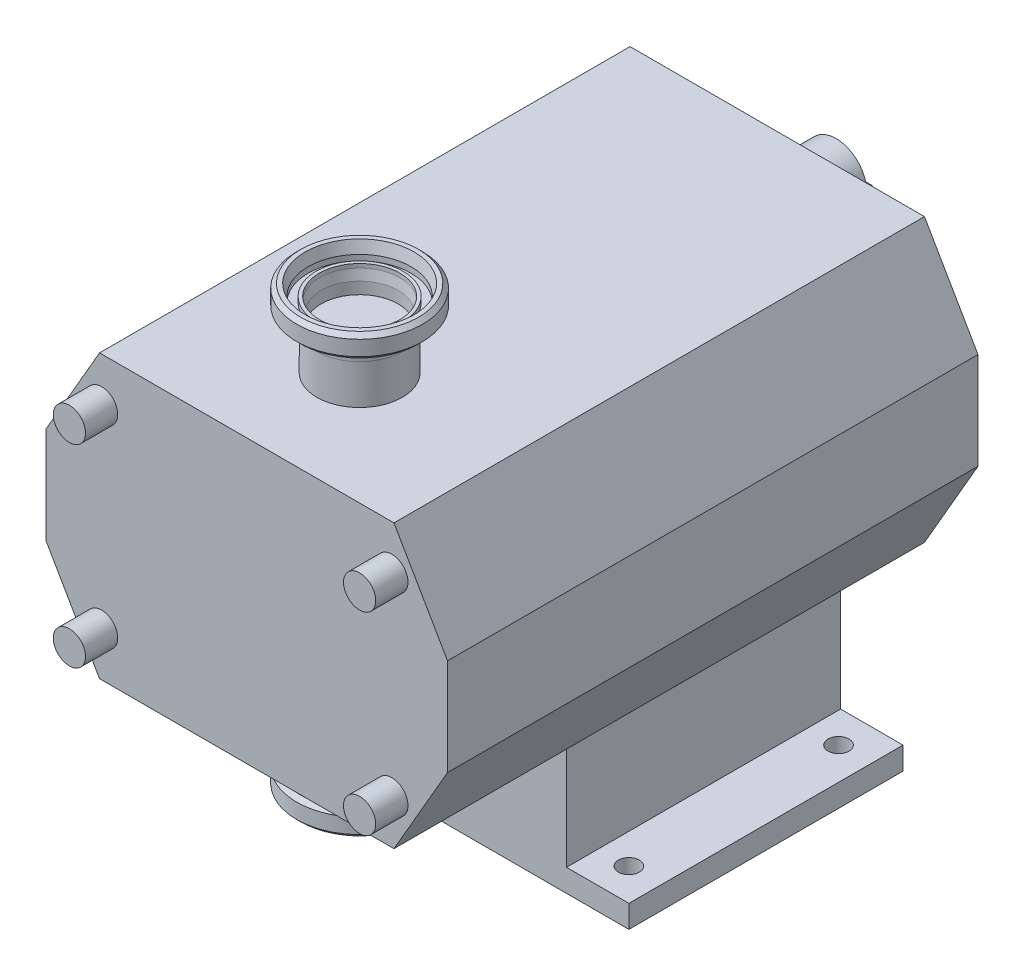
ISO-10303-21;
HEADER;
FILE_DESCRIPTION(('STEP AP214'),'2;1');
FILE_NAME('part.step','',(''),(''),'','','');
FILE_SCHEMA(('AUTOMOTIVE_DESIGN { 1 0 10303 214 1 1 1 1 }'));
ENDSEC;
DATA;
#1=APPLICATION_CONTEXT('core data for automotive mechanical design processes');
#2=APPLICATION_PROTOCOL_DEFINITION('international standard','automotive_design',2000,#1);
#3=PRODUCT_CONTEXT('',#1,'mechanical');
#4=PRODUCT('Part','Part','',(#3));
#5=PRODUCT_RELATED_PRODUCT_CATEGORY('part','',(#4));
#6=PRODUCT_DEFINITION_FORMATION('','',#4);
#7=PRODUCT_DEFINITION_CONTEXT('part definition',#1,'design');
#8=PRODUCT_DEFINITION('design','',#6,#7);
#9=PRODUCT_DEFINITION_SHAPE('','',#8);
#10=(LENGTH_UNIT() NAMED_UNIT(*) SI_UNIT(.MILLI.,.METRE.));
#11=(NAMED_UNIT(*) PLANE_ANGLE_UNIT() SI_UNIT($,.RADIAN.));
#12=(NAMED_UNIT(*) SI_UNIT($,.STERADIAN.) SOLID_ANGLE_UNIT());
#13=UNCERTAINTY_MEASURE_WITH_UNIT(LENGTH_MEASURE(1.E-05),#10,'distance_accuracy_value','');
#14=(GEOMETRIC_REPRESENTATION_CONTEXT(3) GLOBAL_UNCERTAINTY_ASSIGNED_CONTEXT((#13)) GLOBAL_UNIT_ASSIGNED_CONTEXT((#10,
#11,#12)) REPRESENTATION_CONTEXT('',''));
#15=CARTESIAN_POINT('',(0.,0.,0.));
#16=DIRECTION('',(0.,0.,1.));
#17=DIRECTION('',(1.,0.,0.));
#18=AXIS2_PLACEMENT_3D('',#15,#16,#17);
#19=CARTESIAN_POINT('',(-24.3219270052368,-125.,247.276354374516));
#20=DIRECTION('',(0.,-1.,0.));
#21=DIRECTION('',(-0.434209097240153,0.,0.900812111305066));
#22=AXIS2_PLACEMENT_3D('',#19,#20,#21);
#23=PLANE('',#22);
#24=CARTESIAN_POINT('',(0.,-125.,259.));
#25=DIRECTION('',(0.,1.,0.));
#26=DIRECTION('',(0.434209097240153,0.,-0.900812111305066));
#27=AXIS2_PLACEMENT_3D('',#24,#25,#26);
#28=CIRCLE('',#27,27.);
#29=CARTESIAN_POINT('',(11.7236456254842,-125.,234.678072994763));
#30=VERTEX_POINT('',#29);
#31=EDGE_CURVE('P0_E66',#30,#30,#28,.T.);
#32=ORIENTED_EDGE('',*,*,#31,.T.);
#33=EDGE_LOOP('',(#32));
#34=FACE_BOUND('',#33,.T.);
#35=CARTESIAN_POINT('',(0.,-125.,259.));
#36=DIRECTION('',(0.,1.,0.));
#37=DIRECTION('',(0.434209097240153,0.,-0.900812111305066));
#38=AXIS2_PLACEMENT_3D('',#35,#36,#37);
#39=CIRCLE('',#38,31.9);
#40=CARTESIAN_POINT('',(13.8512702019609,-125.,230.264093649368));
#41=VERTEX_POINT('',#40);
#42=EDGE_CURVE('P0_E9',#41,#41,#39,.T.);
#43=ORIENTED_EDGE('',*,*,#42,.F.);
#44=EDGE_LOOP('',(#43));
#45=FACE_BOUND('',#44,.T.);
#46=ADVANCED_FACE('P0_F14',(#34,#45),#23,.T.);
#47=CARTESIAN_POINT('',(0.,-112.5,259.));
#48=DIRECTION('',(0.,1.,0.));
#49=DIRECTION('',(0.434209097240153,0.,-0.900812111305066));
#50=AXIS2_PLACEMENT_3D('',#47,#48,#49);
#51=CYLINDRICAL_SURFACE('',#50,31.9);
#52=ORIENTED_EDGE('',*,*,#42,.T.);
#53=EDGE_LOOP('',(#52));
#54=FACE_BOUND('',#53,.T.);
#55=CARTESIAN_POINT('',(0.,-128.5,259.));
#56=DIRECTION('',(0.,1.,0.));
#57=DIRECTION('',(0.434209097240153,0.,-0.900812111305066));
#58=AXIS2_PLACEMENT_3D('',#55,#56,#57);
#59=CIRCLE('',#58,31.9);
#60=CARTESIAN_POINT('',(13.8512702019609,-128.5,230.264093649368));
#61=VERTEX_POINT('',#60);
#62=EDGE_CURVE('P0_E20',#61,#61,#59,.T.);
#63=ORIENTED_EDGE('',*,*,#62,.F.);
#64=EDGE_LOOP('',(#63));
#65=FACE_BOUND('',#64,.T.);
#66=ADVANCED_FACE('P0_F85',(#54,#65),#51,.F.);
#67=CARTESIAN_POINT('',(0.,-135.5,259.));
#68=DIRECTION('',(0.,-1.,0.));
#69=DIRECTION('',(-0.434209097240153,0.,0.900812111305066));
#70=AXIS2_PLACEMENT_3D('',#67,#68,#69);
#71=CONICAL_SURFACE('',#70,33.7756443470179,0.261799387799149);
#72=ORIENTED_EDGE('',*,*,#62,.T.);
#73=EDGE_LOOP('',(#72));
#74=FACE_BOUND('',#73,.T.);
#75=CARTESIAN_POINT('',(0.,-135.5,259.));
#76=DIRECTION('',(0.,1.,0.));
#77=DIRECTION('',(0.434209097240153,0.,-0.900812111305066));
#78=AXIS2_PLACEMENT_3D('',#75,#76,#77);
#79=CIRCLE('',#78,33.7756443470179);
#80=CARTESIAN_POINT('',(14.6656920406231,-135.5,228.574490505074));
#81=VERTEX_POINT('',#80);
#82=EDGE_CURVE('P0_E24',#81,#81,#79,.T.);
#83=ORIENTED_EDGE('',*,*,#82,.F.);
#84=EDGE_LOOP('',(#83));
#85=FACE_BOUND('',#84,.T.);
#86=ADVANCED_FACE('P0_F89',(#74,#85),#71,.F.);
#87=CARTESIAN_POINT('',(-30.4255094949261,-135.5,244.334307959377));
#88=DIRECTION('',(0.,-1.,0.));
#89=DIRECTION('',(-0.434209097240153,0.,0.900812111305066));
#90=AXIS2_PLACEMENT_3D('',#87,#88,#89);
#91=PLANE('',#90);
#92=ORIENTED_EDGE('',*,*,#82,.T.);
#93=EDGE_LOOP('',(#92));
#94=FACE_BOUND('',#93,.T.);
#95=CARTESIAN_POINT('',(0.,-135.5,259.));
#96=DIRECTION('',(0.,1.,0.));
#97=DIRECTION('',(0.434209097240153,0.,-0.900812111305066));
#98=AXIS2_PLACEMENT_3D('',#95,#96,#97);
#99=CIRCLE('',#98,36.5);
#100=CARTESIAN_POINT('',(15.8486320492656,-135.5,226.120357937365));
#101=VERTEX_POINT('',#100);
#102=EDGE_CURVE('P0_E28',#101,#101,#99,.T.);
#103=ORIENTED_EDGE('',*,*,#102,.F.);
#104=EDGE_LOOP('',(#103));
#105=FACE_BOUND('',#104,.T.);
#106=ADVANCED_FACE('P0_F93',(#94,#105),#91,.T.);
#107=CARTESIAN_POINT('',(0.,-133.,259.));
#108=DIRECTION('',(0.,1.,0.));
#109=DIRECTION('',(0.434209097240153,0.,-0.900812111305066));
#110=AXIS2_PLACEMENT_3D('',#107,#108,#109);
#111=CONICAL_SURFACE('',#110,39.,0.785398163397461);
#112=ORIENTED_EDGE('',*,*,#102,.T.);
#113=EDGE_LOOP('',(#112));
#114=FACE_BOUND('',#113,.T.);
#115=CARTESIAN_POINT('',(0.,-133.,259.));
#116=DIRECTION('',(0.,1.,0.));
#117=DIRECTION('',(0.434209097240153,0.,-0.900812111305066));
#118=AXIS2_PLACEMENT_3D('',#115,#116,#117);
#119=CIRCLE('',#118,39.);
#120=CARTESIAN_POINT('',(16.934154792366,-133.,223.868327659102));
#121=VERTEX_POINT('',#120);
#122=EDGE_CURVE('P0_E33',#121,#121,#119,.T.);
#123=ORIENTED_EDGE('',*,*,#122,.F.);
#124=EDGE_LOOP('',(#123));
#125=FACE_BOUND('',#124,.T.);
#126=ADVANCED_FACE('P0_F99',(#114,#125),#111,.T.);
#127=CARTESIAN_POINT('',(0.,-112.5,259.));
#128=DIRECTION('',(0.,1.,0.));
#129=DIRECTION('',(0.434209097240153,0.,-0.900812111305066));
#130=AXIS2_PLACEMENT_3D('',#127,#128,#129);
#131=CYLINDRICAL_SURFACE('',#130,39.);
#132=ORIENTED_EDGE('',*,*,#122,.T.);
#133=EDGE_LOOP('',(#132));
#134=FACE_BOUND('',#133,.T.);
#135=CARTESIAN_POINT('',(0.,-123.67510631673,259.));
#136=DIRECTION('',(0.,1.,0.));
#137=DIRECTION('',(0.434209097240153,0.,-0.900812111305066));
#138=AXIS2_PLACEMENT_3D('',#135,#136,#137);
#139=CIRCLE('',#138,39.);
#140=CARTESIAN_POINT('',(16.934154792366,-123.67510631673,223.868327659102));
#141=VERTEX_POINT('',#140);
#142=EDGE_CURVE('P0_E36',#141,#141,#139,.T.);
#143=ORIENTED_EDGE('',*,*,#142,.F.);
#144=EDGE_LOOP('',(#143));
#145=FACE_BOUND('',#144,.T.);
#146=ADVANCED_FACE('P0_F103',(#134,#145),#131,.T.);
#147=CARTESIAN_POINT('',(0.,-121.17510631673,259.));
#148=DIRECTION('',(0.,-1.,0.));
#149=DIRECTION('',(-0.434209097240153,0.,0.900812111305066));
#150=AXIS2_PLACEMENT_3D('',#147,#148,#149);
#151=CONICAL_SURFACE('',#150,36.5,0.785398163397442);
#152=ORIENTED_EDGE('',*,*,#142,.T.);
#153=EDGE_LOOP('',(#152));
#154=FACE_BOUND('',#153,.T.);
#155=CARTESIAN_POINT('',(0.,-121.17510631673,259.));
#156=DIRECTION('',(0.,1.,0.));
#157=DIRECTION('',(0.434209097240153,0.,-0.900812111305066));
#158=AXIS2_PLACEMENT_3D('',#155,#156,#157);
#159=CIRCLE('',#158,36.5);
#160=CARTESIAN_POINT('',(15.8486320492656,-121.17510631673,226.120357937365));
#161=VERTEX_POINT('',#160);
#162=EDGE_CURVE('P0_E39',#161,#161,#159,.T.);
#163=ORIENTED_EDGE('',*,*,#162,.F.);
#164=EDGE_LOOP('',(#163));
#165=FACE_BOUND('',#164,.T.);
#166=ADVANCED_FACE('P0_F107',(#154,#165),#151,.T.);
#167=CARTESIAN_POINT('',(0.,-119.864270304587,259.));
#168=DIRECTION('',(0.,-1.,0.));
#169=DIRECTION('',(-0.434209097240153,0.,0.900812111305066));
#170=AXIS2_PLACEMENT_3D('',#167,#168,#169);
#171=CONICAL_SURFACE('',#170,29.0658795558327,1.39626340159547);
#172=ORIENTED_EDGE('',*,*,#162,.T.);
#173=EDGE_LOOP('',(#172));
#174=FACE_BOUND('',#173,.T.);
#175=CARTESIAN_POINT('',(0.,-119.864270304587,259.));
#176=DIRECTION('',(0.,1.,0.));
#177=DIRECTION('',(0.434209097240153,0.,-0.900812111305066));
#178=AXIS2_PLACEMENT_3D('',#175,#176,#177);
#179=CIRCLE('',#178,29.0658795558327);
#180=CARTESIAN_POINT('',(12.6206693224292,-119.864270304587,232.817103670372));
#181=VERTEX_POINT('',#180);
#182=EDGE_CURVE('P0_E42',#181,#181,#179,.T.);
#183=ORIENTED_EDGE('',*,*,#182,.F.);
#184=EDGE_LOOP('',(#183));
#185=FACE_BOUND('',#184,.T.);
#186=ADVANCED_FACE('P0_F111',(#174,#185),#171,.T.);
#187=CARTESIAN_POINT('',(0.,-117.402250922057,259.));
#188=DIRECTION('',(0.,1.,0.));
#189=DIRECTION('',(0.434209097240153,0.,-0.900812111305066));
#190=AXIS2_PLACEMENT_3D('',#187,#188,#189);
#191=TOROIDAL_SURFACE('',#190,29.5,2.5);
#192=ORIENTED_EDGE('',*,*,#182,.T.);
#193=EDGE_LOOP('',(#192));
#194=FACE_BOUND('',#193,.T.);
#195=CARTESIAN_POINT('',(0.,-117.402250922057,259.));
#196=DIRECTION('',(0.,1.,0.));
#197=DIRECTION('',(0.434209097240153,0.,-0.900812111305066));
#198=AXIS2_PLACEMENT_3D('',#195,#196,#197);
#199=CIRCLE('',#198,27.);
#200=CARTESIAN_POINT('',(11.7236456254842,-117.402250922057,234.678072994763));
#201=VERTEX_POINT('',#200);
#202=EDGE_CURVE('P0_E45',#201,#201,#199,.T.);
#203=ORIENTED_EDGE('',*,*,#202,.F.);
#204=EDGE_LOOP('',(#203));
#205=FACE_BOUND('',#204,.T.);
#206=ADVANCED_FACE('P0_F115',(#194,#205),#191,.F.);
#207=CARTESIAN_POINT('',(0.,-112.5,259.));
#208=DIRECTION('',(0.,1.,0.));
#209=DIRECTION('',(0.434209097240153,0.,-0.900812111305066));
#210=AXIS2_PLACEMENT_3D('',#207,#208,#209);
#211=CYLINDRICAL_SURFACE('',#210,27.);
#212=ORIENTED_EDGE('',*,*,#202,.T.);
#213=EDGE_LOOP('',(#212));
#214=FACE_BOUND('',#213,.T.);
#215=CARTESIAN_POINT('',(0.,-112.5,259.));
#216=DIRECTION('',(0.,1.,0.));
#217=DIRECTION('',(0.434209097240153,0.,-0.900812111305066));
#218=AXIS2_PLACEMENT_3D('',#215,#216,#217);
#219=CIRCLE('',#218,27.);
#220=CARTESIAN_POINT('',(11.7236456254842,-112.5,234.678072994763));
#221=VERTEX_POINT('',#220);
#222=EDGE_CURVE('P0_E48',#221,#221,#219,.T.);
#223=ORIENTED_EDGE('',*,*,#222,.F.);
#224=EDGE_LOOP('',(#223));
#225=FACE_BOUND('',#224,.T.);
#226=ADVANCED_FACE('P0_F119',(#214,#225),#211,.T.);
#227=CARTESIAN_POINT('',(-21.529409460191,-112.5,248.62240257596));
#228=DIRECTION('',(0.,1.,0.));
#229=DIRECTION('',(0.434209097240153,0.,-0.900812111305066));
#230=AXIS2_PLACEMENT_3D('',#227,#228,#229);
#231=PLANE('',#230);
#232=ORIENTED_EDGE('',*,*,#222,.T.);
#233=EDGE_LOOP('',(#232));
#234=FACE_BOUND('',#233,.T.);
#235=CARTESIAN_POINT('',(0.,-112.5,259.));
#236=DIRECTION('',(0.,1.,0.));
#237=DIRECTION('',(0.434209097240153,0.,-0.900812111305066));
#238=AXIS2_PLACEMENT_3D('',#235,#236,#237);
#239=CIRCLE('',#238,23.9);
#240=CARTESIAN_POINT('',(10.3775974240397,-112.5,237.470590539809));
#241=VERTEX_POINT('',#240);
#242=EDGE_CURVE('P0_E51',#241,#241,#239,.T.);
#243=ORIENTED_EDGE('',*,*,#242,.F.);
#244=EDGE_LOOP('',(#243));
#245=FACE_BOUND('',#244,.T.);
#246=ADVANCED_FACE('P0_F123',(#234,#245),#231,.T.);
#247=CARTESIAN_POINT('',(0.,-112.5,259.));
#248=DIRECTION('',(0.,1.,0.));
#249=DIRECTION('',(0.434209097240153,0.,-0.900812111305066));
#250=AXIS2_PLACEMENT_3D('',#247,#248,#249);
#251=CYLINDRICAL_SURFACE('',#250,23.9);
#252=ORIENTED_EDGE('',*,*,#242,.T.);
#253=EDGE_LOOP('',(#252));
#254=FACE_BOUND('',#253,.T.);
#255=CARTESIAN_POINT('',(0.,-119.761589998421,259.));
#256=DIRECTION('',(0.,1.,0.));
#257=DIRECTION('',(0.434209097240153,0.,-0.900812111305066));
#258=AXIS2_PLACEMENT_3D('',#255,#256,#257);
#259=CIRCLE('',#258,23.9);
#260=CARTESIAN_POINT('',(10.3775974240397,-119.761589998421,237.470590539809));
#261=VERTEX_POINT('',#260);
#262=EDGE_CURVE('P0_E54',#261,#261,#259,.T.);
#263=ORIENTED_EDGE('',*,*,#262,.F.);
#264=EDGE_LOOP('',(#263));
#265=FACE_BOUND('',#264,.T.);
#266=ADVANCED_FACE('P0_F127',(#254,#265),#251,.F.);
#267=CARTESIAN_POINT('',(0.,-126.,259.));
#268=DIRECTION('',(0.,-1.,0.));
#269=DIRECTION('',(-0.434209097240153,0.,0.900812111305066));
#270=AXIS2_PLACEMENT_3D('',#267,#268,#269);
#271=CONICAL_SURFACE('',#270,25.,0.174532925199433);
#272=ORIENTED_EDGE('',*,*,#262,.T.);
#273=EDGE_LOOP('',(#272));
#274=FACE_BOUND('',#273,.T.);
#275=CARTESIAN_POINT('',(0.,-126.,259.));
#276=DIRECTION('',(0.,1.,0.));
#277=DIRECTION('',(0.434209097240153,0.,-0.900812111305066));
#278=AXIS2_PLACEMENT_3D('',#275,#276,#277);
#279=CIRCLE('',#278,25.);
#280=CARTESIAN_POINT('',(10.8552274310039,-126.,236.479697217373));
#281=VERTEX_POINT('',#280);
#282=EDGE_CURVE('P0_E57',#281,#281,#279,.T.);
#283=ORIENTED_EDGE('',*,*,#282,.F.);
#284=EDGE_LOOP('',(#283));
#285=FACE_BOUND('',#284,.T.);
#286=ADVANCED_FACE('P0_F131',(#274,#285),#271,.F.);
#287=CARTESIAN_POINT('',(0.,-112.5,259.));
#288=DIRECTION('',(0.,1.,0.));
#289=DIRECTION('',(0.434209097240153,0.,-0.900812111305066));
#290=AXIS2_PLACEMENT_3D('',#287,#288,#289);
#291=CYLINDRICAL_SURFACE('',#290,25.);
#292=ORIENTED_EDGE('',*,*,#282,.T.);
#293=EDGE_LOOP('',(#292));
#294=FACE_BOUND('',#293,.T.);
#295=CARTESIAN_POINT('',(0.,-128.5,259.));
#296=DIRECTION('',(0.,1.,0.));
#297=DIRECTION('',(0.434209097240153,0.,-0.900812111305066));
#298=AXIS2_PLACEMENT_3D('',#295,#296,#297);
#299=CIRCLE('',#298,25.);
#300=CARTESIAN_POINT('',(10.8552274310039,-128.5,236.479697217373));
#301=VERTEX_POINT('',#300);
#302=EDGE_CURVE('P0_E60',#301,#301,#299,.T.);
#303=ORIENTED_EDGE('',*,*,#302,.F.);
#304=EDGE_LOOP('',(#303));
#305=FACE_BOUND('',#304,.T.);
#306=ADVANCED_FACE('P0_F81',(#294,#305),#291,.F.);
#307=CARTESIAN_POINT('',(-22.5203027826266,-128.5,248.144772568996));
#308=DIRECTION('',(0.,-1.,0.));
#309=DIRECTION('',(-0.434209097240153,0.,0.900812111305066));
#310=AXIS2_PLACEMENT_3D('',#307,#308,#309);
#311=PLANE('',#310);
#312=ORIENTED_EDGE('',*,*,#302,.T.);
#313=EDGE_LOOP('',(#312));
#314=FACE_BOUND('',#313,.T.);
#315=CARTESIAN_POINT('',(0.,-128.5,259.));
#316=DIRECTION('',(0.,1.,0.));
#317=DIRECTION('',(0.434209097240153,0.,-0.900812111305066));
#318=AXIS2_PLACEMENT_3D('',#315,#316,#317);
#319=CIRCLE('',#318,27.);
#320=CARTESIAN_POINT('',(11.7236456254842,-128.5,234.678072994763));
#321=VERTEX_POINT('',#320);
#322=EDGE_CURVE('P0_E63',#321,#321,#319,.T.);
#323=ORIENTED_EDGE('',*,*,#322,.F.);
#324=EDGE_LOOP('',(#323));
#325=FACE_BOUND('',#324,.T.);
#326=ADVANCED_FACE('P0_F74',(#314,#325),#311,.T.);
#327=CARTESIAN_POINT('',(0.,-112.5,259.));
#328=DIRECTION('',(0.,1.,0.));
#329=DIRECTION('',(0.434209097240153,0.,-0.900812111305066));
#330=AXIS2_PLACEMENT_3D('',#327,#328,#329);
#331=CYLINDRICAL_SURFACE('',#330,27.);
#332=ORIENTED_EDGE('',*,*,#322,.T.);
#333=EDGE_LOOP('',(#332));
#334=FACE_BOUND('',#333,.T.);
#335=ORIENTED_EDGE('',*,*,#31,.F.);
#336=EDGE_LOOP('',(#335));
#337=FACE_BOUND('',#336,.T.);
#338=ADVANCED_FACE('P0_F72',(#334,#337),#331,.T.);
#339=CLOSED_SHELL('',(#46,#66,#86,#106,#126,#146,#166,#186,#206,#226,#246,#266,#286,#306,#326,#338));
#340=MANIFOLD_SOLID_BREP('P0_B1',#339);
#341=CARTESIAN_POINT('',(-46.5,0.,241.732657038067));
#342=DIRECTION('',(0.,0.,1.));
#343=DIRECTION('',(1.,0.,0.));
#344=AXIS2_PLACEMENT_3D('',#341,#342,#343);
#345=CYLINDRICAL_SURFACE('',#344,19.);
#346=CARTESIAN_POINT('',(-46.5,0.,-3.));
#347=DIRECTION('',(0.,0.,1.));
#348=DIRECTION('',(1.,0.,0.));
#349=AXIS2_PLACEMENT_3D('',#346,#347,#348);
#350=CIRCLE('',#349,19.);
#351=CARTESIAN_POINT('',(-27.5,0.,-3.));
#352=VERTEX_POINT('',#351);
#353=EDGE_CURVE('P1_E277',#352,#352,#350,.T.);
#354=ORIENTED_EDGE('',*,*,#353,.F.);
#355=EDGE_LOOP('',(#354));
#356=FACE_BOUND('',#355,.T.);
#357=DIRECTION('',(0.,0.,1.));
#358=VECTOR('',#357,1.);
#359=CARTESIAN_POINT('',(-28.1696972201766,4.99999999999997,241.732657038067));
#360=LINE('',#359,#358);
#361=CARTESIAN_POINT('',(-28.1696972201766,5.,-83.));
#362=VERTEX_POINT('',#361);
#363=CARTESIAN_POINT('',(-28.1696972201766,5.,-43.));
#364=VERTEX_POINT('',#363);
#365=EDGE_CURVE('P1_E178',#362,#364,#360,.T.);
#366=ORIENTED_EDGE('',*,*,#365,.F.);
#367=CARTESIAN_POINT('',(-46.5,0.,-83.));
#368=DIRECTION('',(0.,0.,1.));
#369=DIRECTION('',(1.,0.,0.));
#370=AXIS2_PLACEMENT_3D('',#367,#368,#369);
#371=CIRCLE('',#370,19.);
#372=CARTESIAN_POINT('',(-28.1696972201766,-5.,-83.));
#373=VERTEX_POINT('',#372);
#374=EDGE_CURVE('P1_E176',#362,#373,#371,.T.);
#375=ORIENTED_EDGE('',*,*,#374,.T.);
#376=DIRECTION('',(0.,0.,1.));
#377=VECTOR('',#376,1.);
#378=CARTESIAN_POINT('',(-28.1696972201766,-5.00000000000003,241.732657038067));
#379=LINE('',#378,#377);
#380=CARTESIAN_POINT('',(-28.1696972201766,-5.00000000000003,-43.));
#381=VERTEX_POINT('',#380);
#382=EDGE_CURVE('P1_E39',#381,#373,#379,.F.);
#383=ORIENTED_EDGE('',*,*,#382,.F.);
#384=CARTESIAN_POINT('',(-27.5,0.,-48.));
#385=CARTESIAN_POINT('',(-27.5000042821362,0.275769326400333,-47.9999931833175));
#386=CARTESIAN_POINT('',(-27.5060630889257,0.551612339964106,-47.9771088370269));
#387=CARTESIAN_POINT('',(-27.5296447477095,1.09536084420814,-47.8863327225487));
#388=CARTESIAN_POINT('',(-27.5471733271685,1.36326229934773,-47.8184184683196));
#389=CARTESIAN_POINT('',(-27.5917584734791,1.88319959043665,-47.6399368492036));
#390=CARTESIAN_POINT('',(-27.6188029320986,2.1352551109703,-47.5294236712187));
#391=CARTESIAN_POINT('',(-27.6795569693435,2.61725305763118,-47.2690799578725));
#392=CARTESIAN_POINT('',(-27.7132669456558,2.84719416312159,-47.1192470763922));
#393=CARTESIAN_POINT('',(-27.7845611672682,3.2836398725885,-46.7809367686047));
#394=CARTESIAN_POINT('',(-27.8222102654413,3.48957269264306,-46.591735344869));
#395=CARTESIAN_POINT('',(-27.8967199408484,3.86718169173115,-46.1816068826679));
#396=CARTESIAN_POINT('',(-27.9335804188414,4.03885358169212,-45.9606758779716));
#397=CARTESIAN_POINT('',(-28.0030006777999,4.34583417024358,-45.4888224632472));
#398=CARTESIAN_POINT('',(-28.0354785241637,4.48048899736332,-45.237461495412));
#399=CARTESIAN_POINT('',(-28.0915043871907,4.7054029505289,-44.7146757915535));
#400=CARTESIAN_POINT('',(-28.1150540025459,4.79567002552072,-44.4432546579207));
#401=CARTESIAN_POINT('',(-28.1498881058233,4.92726790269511,-43.8943761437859));
#402=CARTESIAN_POINT('',(-28.1614315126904,4.96963355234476,-43.6171837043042));
#403=CARTESIAN_POINT('',(-28.171720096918,5.00745164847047,-43.0594039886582));
#404=CARTESIAN_POINT('',(-28.1704675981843,5.00291261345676,-42.7788173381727));
#405=CARTESIAN_POINT('',(-28.1555378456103,4.9478726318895,-42.2302595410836));
#406=CARTESIAN_POINT('',(-28.1421979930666,4.89861973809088,-41.9621525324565));
#407=CARTESIAN_POINT('',(-28.1051362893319,4.75754734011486,-41.4381479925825));
#408=CARTESIAN_POINT('',(-28.0814136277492,4.6657245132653,-41.1822514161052));
#409=CARTESIAN_POINT('',(-28.0259597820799,4.44109179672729,-40.6866584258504));
#410=CARTESIAN_POINT('',(-27.9941431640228,4.30784106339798,-40.4471717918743));
#411=CARTESIAN_POINT('',(-27.926132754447,4.00444274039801,-39.9935172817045));
#412=CARTESIAN_POINT('',(-27.8899381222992,3.83428805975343,-39.7793542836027));
#413=CARTESIAN_POINT('',(-27.8158419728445,3.45551254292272,-39.3752910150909));
#414=CARTESIAN_POINT('',(-27.7779227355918,3.24584253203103,-39.1863761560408));
#415=CARTESIAN_POINT('',(-27.705680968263,2.79733618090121,-38.8461906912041));
#416=CARTESIAN_POINT('',(-27.671358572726,2.55849875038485,-38.6949214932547));
#417=CARTESIAN_POINT('',(-27.6099756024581,2.05693717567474,-38.4339031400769));
#418=CARTESIAN_POINT('',(-27.5829456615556,1.79411828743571,-38.3243283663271));
#419=CARTESIAN_POINT('',(-27.5394148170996,1.25291705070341,-38.151199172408));
#420=CARTESIAN_POINT('',(-27.5229116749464,0.974538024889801,-38.0876349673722));
#421=CARTESIAN_POINT('',(-27.5026308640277,0.418531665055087,-38.009869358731));
#422=CARTESIAN_POINT('',(-27.4985077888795,0.141104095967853,-37.9943277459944));
#423=CARTESIAN_POINT('',(-27.5024606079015,-0.412392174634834,-38.0093527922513));
#424=CARTESIAN_POINT('',(-27.5105352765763,-0.688461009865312,-38.0399148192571));
#425=CARTESIAN_POINT('',(-27.5377535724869,-1.22664703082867,-38.1451790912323));
#426=CARTESIAN_POINT('',(-27.5567105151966,-1.48892004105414,-38.2191373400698));
#427=CARTESIAN_POINT('',(-27.6035461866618,-1.99731390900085,-38.4082337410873));
#428=CARTESIAN_POINT('',(-27.6314258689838,-2.24343303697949,-38.5233762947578));
#429=CARTESIAN_POINT('',(-27.6938277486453,-2.71776721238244,-38.7940826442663));
#430=CARTESIAN_POINT('',(-27.7284672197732,-2.9455476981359,-38.9503801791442));
#431=CARTESIAN_POINT('',(-27.8003827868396,-3.3721194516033,-39.298034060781));
#432=CARTESIAN_POINT('',(-27.8376593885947,-3.5709051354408,-39.4893971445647));
#433=CARTESIAN_POINT('',(-27.9119129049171,-3.93946537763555,-39.9079980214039));
#434=CARTESIAN_POINT('',(-27.9488536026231,-4.10829545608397,-40.1360753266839));
#435=CARTESIAN_POINT('',(-28.0171260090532,-4.40530154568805,-40.6181009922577));
#436=CARTESIAN_POINT('',(-28.048457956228,-4.5334792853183,-40.8720482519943));
#437=CARTESIAN_POINT('',(-28.1016076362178,-4.74457728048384,-41.3973124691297));
#438=CARTESIAN_POINT('',(-28.1234807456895,-4.82776168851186,-41.6685173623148));
#439=CARTESIAN_POINT('',(-28.1552579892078,-4.94715371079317,-42.2217364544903));
#440=CARTESIAN_POINT('',(-28.1651650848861,-4.98337294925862,-42.5037479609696));
#441=CARTESIAN_POINT('',(-28.1716457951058,-5.00715081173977,-43.0609183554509));
#442=CARTESIAN_POINT('',(-28.1686348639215,-4.99622557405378,-43.3360086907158));
#443=CARTESIAN_POINT('',(-28.1505888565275,-4.92953140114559,-43.8802760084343));
#444=CARTESIAN_POINT('',(-28.1355540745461,-4.87376356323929,-44.1494531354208));
#445=CARTESIAN_POINT('',(-28.095398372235,-4.71983552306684,-44.6724009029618));
#446=CARTESIAN_POINT('',(-28.0703520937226,-4.6219886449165,-44.9262699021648));
#447=CARTESIAN_POINT('',(-28.012991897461,-4.38692411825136,-45.4141783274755));
#448=CARTESIAN_POINT('',(-27.9806768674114,-4.24970044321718,-45.648214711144));
#449=CARTESIAN_POINT('',(-27.9112611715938,-3.93514861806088,-46.0970708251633));
#450=CARTESIAN_POINT('',(-27.8740497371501,-3.7567820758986,-46.3111458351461));
#451=CARTESIAN_POINT('',(-27.7996615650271,-3.36699304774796,-46.7068188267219));
#452=CARTESIAN_POINT('',(-27.7624848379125,-3.15556257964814,-46.8884089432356));
#453=CARTESIAN_POINT('',(-27.6914364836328,-2.7003741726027,-47.2176404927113));
#454=CARTESIAN_POINT('',(-27.6576490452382,-2.45603841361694,-47.3645027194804));
#455=CARTESIAN_POINT('',(-27.5980996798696,-1.94526775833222,-47.6148349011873));
#456=CARTESIAN_POINT('',(-27.5723324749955,-1.67884754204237,-47.7183334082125));
#457=CARTESIAN_POINT('',(-27.5351625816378,-1.17775159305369,-47.8650961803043));
#458=CARTESIAN_POINT('',(-27.5220714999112,-0.945286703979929,-47.9155694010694));
#459=CARTESIAN_POINT('',(-27.5044887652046,-0.475232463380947,-47.9830226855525));
#460=CARTESIAN_POINT('',(-27.4999963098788,-0.237643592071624,-48.0000058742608));
#461=CARTESIAN_POINT('',(-27.5,0.,-48.));
#462=B_SPLINE_CURVE_WITH_KNOTS('',3,(#384,#385,#386,#387,#388,#389,#390,#391,#392,#393,#394,
#395,#396,#397,#398,#399,#400,#401,#402,#403,#404,#405,#406,#407,#408,#409,#410,#411,#412,#413,
#414,#415,#416,#417,#418,#419,#420,#421,#422,#423,#424,#425,#426,#427,#428,#429,#430,#431,#432,
#433,#434,#435,#436,#437,#438,#439,#440,#441,#442,#443,#444,#445,#446,#447,#448,#449,#450,#451,
#452,#453,#454,#455,#456,#457,#458,#459,#460,#461),.UNSPECIFIED.,.T.,.F.,(4,2,2,2,2,2,2,2,2,2,2,
2,2,2,2,2,2,2,2,2,2,2,2,2,2,2,2,2,2,2,2,2,2,2,2,2,2,2,4),(0.,0.826436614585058,1.65328622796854,
2.47908752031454,3.30493809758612,4.14758534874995,4.99033802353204,5.84713921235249,
6.70378690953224,7.54155141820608,8.37916378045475,9.19409222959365,10.0090842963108,
10.8330642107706,11.6572025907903,12.5074895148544,13.35780823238,14.2116451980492,
15.0653005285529,15.8949065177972,16.7244291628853,17.5401294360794,18.3559169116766,
19.187369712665,20.0189824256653,20.873388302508,21.7277578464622,22.577055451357,
23.4261428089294,24.2481310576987,25.0700991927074,25.8860500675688,26.702125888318,
27.5416338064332,28.3813447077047,29.2384104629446,30.0949110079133,30.8071573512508,
31.5193372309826),.UNSPECIFIED.);
#463=EDGE_CURVE('P1_E11',#364,#381,#462,.T.);
#464=ORIENTED_EDGE('',*,*,#463,.F.);
#465=EDGE_LOOP('',(#366,#375,#383,#464));
#466=FACE_BOUND('',#465,.T.);
#467=ADVANCED_FACE('P1_F17',(#356,#466),#345,.T.);
#468=CARTESIAN_POINT('',(-91.3023595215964,-87.5,329.));
#469=DIRECTION('',(0.,1.,0.));
#470=DIRECTION('',(-1.,0.,0.));
#471=AXIS2_PLACEMENT_3D('',#468,#469,#470);
#472=PLANE('',#471);
#473=CARTESIAN_POINT('',(0.,-87.5,259.));
#474=DIRECTION('',(0.,1.,0.));
#475=DIRECTION('',(-1.,0.,0.));
#476=AXIS2_PLACEMENT_3D('',#473,#474,#475);
#477=CIRCLE('',#476,26.5);
#478=CARTESIAN_POINT('',(-26.5,-87.5,259.));
#479=VERTEX_POINT('',#478);
#480=EDGE_CURVE('P1_E192',#479,#479,#477,.T.);
#481=ORIENTED_EDGE('',*,*,#480,.T.);
#482=EDGE_LOOP('',(#481));
#483=FACE_BOUND('',#482,.T.);
#484=DIRECTION('',(1.,0.,0.));
#485=VECTOR('',#484,1.);
#486=CARTESIAN_POINT('',(-91.3023595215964,-87.5,0.));
#487=LINE('',#486,#485);
#488=CARTESIAN_POINT('',(-91.3023595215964,-87.5,0.));
#489=VERTEX_POINT('',#488);
#490=CARTESIAN_POINT('',(91.3023595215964,-87.5,0.));
#491=VERTEX_POINT('',#490);
#492=EDGE_CURVE('P1_E328',#489,#491,#487,.T.);
#493=ORIENTED_EDGE('',*,*,#492,.T.);
#494=DIRECTION('',(0.,0.,-1.));
#495=VECTOR('',#494,1.);
#496=CARTESIAN_POINT('',(91.3023595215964,-87.5,329.));
#497=LINE('',#496,#495);
#498=CARTESIAN_POINT('',(91.3023595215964,-87.5,329.));
#499=VERTEX_POINT('',#498);
#500=EDGE_CURVE('P1_E338',#499,#491,#497,.T.);
#501=ORIENTED_EDGE('',*,*,#500,.F.);
#502=DIRECTION('',(1.,0.,0.));
#503=VECTOR('',#502,1.);
#504=CARTESIAN_POINT('',(-91.3023595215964,-87.5,329.));
#505=LINE('',#504,#503);
#506=CARTESIAN_POINT('',(-91.3023595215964,-87.5,329.));
#507=VERTEX_POINT('',#506);
#508=EDGE_CURVE('P1_E311',#507,#499,#505,.T.);
#509=ORIENTED_EDGE('',*,*,#508,.F.);
#510=DIRECTION('',(0.,0.,-1.));
#511=VECTOR('',#510,1.);
#512=CARTESIAN_POINT('',(-91.3023595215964,-87.5,329.));
#513=LINE('',#512,#511);
#514=EDGE_CURVE('P1_E341',#507,#489,#513,.T.);
#515=ORIENTED_EDGE('',*,*,#514,.T.);
#516=EDGE_LOOP('',(#493,#501,#509,#515));
#517=FACE_BOUND('',#516,.T.);
#518=DIRECTION('',(1.,0.,0.));
#519=VECTOR('',#518,1.);
#520=CARTESIAN_POINT('',(66.3023595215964,-87.5,27.));
#521=LINE('',#520,#519);
#522=CARTESIAN_POINT('',(-66.3023595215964,-87.5,27.));
#523=VERTEX_POINT('',#522);
#524=CARTESIAN_POINT('',(66.3023595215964,-87.5,27.));
#525=VERTEX_POINT('',#524);
#526=EDGE_CURVE('P1_E220',#523,#525,#521,.T.);
#527=ORIENTED_EDGE('',*,*,#526,.F.);
#528=DIRECTION('',(0.,0.,1.));
#529=VECTOR('',#528,1.);
#530=CARTESIAN_POINT('',(-66.3023595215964,-87.5,27.));
#531=LINE('',#530,#529);
#532=CARTESIAN_POINT('',(-66.3023595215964,-87.5,197.));
#533=VERTEX_POINT('',#532);
#534=EDGE_CURVE('P1_E238',#523,#533,#531,.T.);
#535=ORIENTED_EDGE('',*,*,#534,.T.);
#536=DIRECTION('',(1.,0.,0.));
#537=VECTOR('',#536,1.);
#538=CARTESIAN_POINT('',(66.3023595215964,-87.5,197.));
#539=LINE('',#538,#537);
#540=CARTESIAN_POINT('',(66.3023595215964,-87.5,197.));
#541=VERTEX_POINT('',#540);
#542=EDGE_CURVE('P1_E219',#533,#541,#539,.T.);
#543=ORIENTED_EDGE('',*,*,#542,.T.);
#544=DIRECTION('',(0.,0.,1.));
#545=VECTOR('',#544,1.);
#546=CARTESIAN_POINT('',(66.3023595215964,-87.5,27.));
#547=LINE('',#546,#545);
#548=EDGE_CURVE('P1_E274',#525,#541,#547,.T.);
#549=ORIENTED_EDGE('',*,*,#548,.F.);
#550=EDGE_LOOP('',(#527,#535,#543,#549));
#551=FACE_BOUND('',#550,.T.);
#552=ADVANCED_FACE('P1_F393',(#483,#517,#551),#472,.F.);
#553=CARTESIAN_POINT('',(0.,245.640325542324,0.));
#554=DIRECTION('',(0.,0.,-1.));
#555=DIRECTION('',(-1.,0.,0.));
#556=AXIS2_PLACEMENT_3D('',#553,#554,#555);
#557=PLANE('',#556);
#558=DIRECTION('',(-0.500000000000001,0.866025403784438,0.));
#559=VECTOR('',#558,1.);
#560=CARTESIAN_POINT('',(91.3023595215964,87.5,0.));
#561=LINE('',#560,#559);
#562=CARTESIAN_POINT('',(124.5,30.,0.));
#563=VERTEX_POINT('',#562);
#564=CARTESIAN_POINT('',(91.3023595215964,87.5,0.));
#565=VERTEX_POINT('',#564);
#566=EDGE_CURVE('P1_E298',#563,#565,#561,.T.);
#567=ORIENTED_EDGE('',*,*,#566,.F.);
#568=DIRECTION('',(0.,1.,0.));
#569=VECTOR('',#568,1.);
#570=CARTESIAN_POINT('',(124.5,30.,0.));
#571=LINE('',#570,#569);
#572=CARTESIAN_POINT('',(124.5,-30.,0.));
#573=VERTEX_POINT('',#572);
#574=EDGE_CURVE('P1_E303',#573,#563,#571,.T.);
#575=ORIENTED_EDGE('',*,*,#574,.F.);
#576=DIRECTION('',(0.500000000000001,0.866025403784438,0.));
#577=VECTOR('',#576,1.);
#578=CARTESIAN_POINT('',(91.3023595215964,-87.5,0.));
#579=LINE('',#578,#577);
#580=EDGE_CURVE('P1_E330',#491,#573,#579,.T.);
#581=ORIENTED_EDGE('',*,*,#580,.F.);
#582=ORIENTED_EDGE('',*,*,#492,.F.);
#583=DIRECTION('',(0.500000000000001,-0.866025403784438,0.));
#584=VECTOR('',#583,1.);
#585=CARTESIAN_POINT('',(-91.3023595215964,-87.5,0.));
#586=LINE('',#585,#584);
#587=CARTESIAN_POINT('',(-124.5,-30.,0.));
#588=VERTEX_POINT('',#587);
#589=EDGE_CURVE('P1_E326',#588,#489,#586,.T.);
#590=ORIENTED_EDGE('',*,*,#589,.F.);
#591=DIRECTION('',(0.,-1.,0.));
#592=VECTOR('',#591,1.);
#593=CARTESIAN_POINT('',(-124.5,30.,0.));
#594=LINE('',#593,#592);
#595=CARTESIAN_POINT('',(-124.5,30.,0.));
#596=VERTEX_POINT('',#595);
#597=EDGE_CURVE('P1_E324',#596,#588,#594,.T.);
#598=ORIENTED_EDGE('',*,*,#597,.F.);
#599=DIRECTION('',(-0.500000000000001,-0.866025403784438,0.));
#600=VECTOR('',#599,1.);
#601=CARTESIAN_POINT('',(-91.3023595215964,87.5,0.));
#602=LINE('',#601,#600);
#603=CARTESIAN_POINT('',(-91.3023595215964,87.5,0.));
#604=VERTEX_POINT('',#603);
#605=EDGE_CURVE('P1_E322',#604,#596,#602,.T.);
#606=ORIENTED_EDGE('',*,*,#605,.F.);
#607=DIRECTION('',(-1.,0.,0.));
#608=VECTOR('',#607,1.);
#609=CARTESIAN_POINT('',(-91.3023595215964,87.5,0.));
#610=LINE('',#609,#608);
#611=EDGE_CURVE('P1_E320',#565,#604,#610,.T.);
#612=ORIENTED_EDGE('',*,*,#611,.F.);
#613=EDGE_LOOP('',(#567,#575,#581,#582,#590,#598,#606,#612));
#614=FACE_BOUND('',#613,.T.);
#615=CARTESIAN_POINT('',(-46.5,0.,0.));
#616=DIRECTION('',(0.,0.,1.));
#617=DIRECTION('',(1.,0.,0.));
#618=AXIS2_PLACEMENT_3D('',#615,#616,#617);
#619=CIRCLE('',#618,22.);
#620=CARTESIAN_POINT('',(-24.5,0.,0.));
#621=VERTEX_POINT('',#620);
#622=EDGE_CURVE('P1_E283',#621,#621,#619,.T.);
#623=ORIENTED_EDGE('',*,*,#622,.T.);
#624=EDGE_LOOP('',(#623));
#625=FACE_BOUND('',#624,.T.);
#626=ADVANCED_FACE('P1_F399',(#614,#625),#557,.T.);
#627=CARTESIAN_POINT('',(0.,245.640325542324,329.));
#628=DIRECTION('',(0.,0.,-1.));
#629=DIRECTION('',(-1.,0.,0.));
#630=AXIS2_PLACEMENT_3D('',#627,#628,#629);
#631=PLANE('',#630);
#632=CARTESIAN_POINT('',(90.,-60.,329.));
#633=DIRECTION('',(0.,0.,-1.));
#634=DIRECTION('',(-1.,0.,0.));
#635=AXIS2_PLACEMENT_3D('',#632,#633,#634);
#636=CIRCLE('',#635,9.99999999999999);
#637=CARTESIAN_POINT('',(80.,-60.,329.));
#638=VERTEX_POINT('',#637);
#639=EDGE_CURVE('P1_E362',#638,#638,#636,.F.);
#640=ORIENTED_EDGE('',*,*,#639,.F.);
#641=EDGE_LOOP('',(#640));
#642=FACE_BOUND('',#641,.T.);
#643=CARTESIAN_POINT('',(-90.,60.,329.));
#644=DIRECTION('',(0.,0.,-1.));
#645=DIRECTION('',(-1.,0.,0.));
#646=AXIS2_PLACEMENT_3D('',#643,#644,#645);
#647=CIRCLE('',#646,9.99999999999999);
#648=CARTESIAN_POINT('',(-100.,60.,329.));
#649=VERTEX_POINT('',#648);
#650=EDGE_CURVE('P1_E356',#649,#649,#647,.F.);
#651=ORIENTED_EDGE('',*,*,#650,.F.);
#652=EDGE_LOOP('',(#651));
#653=FACE_BOUND('',#652,.T.);
#654=DIRECTION('',(-0.500000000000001,0.866025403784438,0.));
#655=VECTOR('',#654,1.);
#656=CARTESIAN_POINT('',(91.3023595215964,87.5,329.));
#657=LINE('',#656,#655);
#658=CARTESIAN_POINT('',(124.5,30.,329.));
#659=VERTEX_POINT('',#658);
#660=CARTESIAN_POINT('',(91.3023595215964,87.5,329.));
#661=VERTEX_POINT('',#660);
#662=EDGE_CURVE('P1_E299',#659,#661,#657,.T.);
#663=ORIENTED_EDGE('',*,*,#662,.T.);
#664=DIRECTION('',(-1.,0.,0.));
#665=VECTOR('',#664,1.);
#666=CARTESIAN_POINT('',(-91.3023595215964,87.5,329.));
#667=LINE('',#666,#665);
#668=CARTESIAN_POINT('',(-91.3023595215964,87.5,329.));
#669=VERTEX_POINT('',#668);
#670=EDGE_CURVE('P1_E302',#661,#669,#667,.T.);
#671=ORIENTED_EDGE('',*,*,#670,.T.);
#672=DIRECTION('',(-0.500000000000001,-0.866025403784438,0.));
#673=VECTOR('',#672,1.);
#674=CARTESIAN_POINT('',(-91.3023595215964,87.5,329.));
#675=LINE('',#674,#673);
#676=CARTESIAN_POINT('',(-124.5,30.,329.));
#677=VERTEX_POINT('',#676);
#678=EDGE_CURVE('P1_E305',#669,#677,#675,.T.);
#679=ORIENTED_EDGE('',*,*,#678,.T.);
#680=DIRECTION('',(0.,-1.,0.));
#681=VECTOR('',#680,1.);
#682=CARTESIAN_POINT('',(-124.5,30.,329.));
#683=LINE('',#682,#681);
#684=CARTESIAN_POINT('',(-124.5,-30.,329.));
#685=VERTEX_POINT('',#684);
#686=EDGE_CURVE('P1_E307',#677,#685,#683,.T.);
#687=ORIENTED_EDGE('',*,*,#686,.T.);
#688=DIRECTION('',(0.500000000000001,-0.866025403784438,0.));
#689=VECTOR('',#688,1.);
#690=CARTESIAN_POINT('',(-91.3023595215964,-87.5,329.));
#691=LINE('',#690,#689);
#692=EDGE_CURVE('P1_E309',#685,#507,#691,.T.);
#693=ORIENTED_EDGE('',*,*,#692,.T.);
#694=ORIENTED_EDGE('',*,*,#508,.T.);
#695=DIRECTION('',(0.500000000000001,0.866025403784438,0.));
#696=VECTOR('',#695,1.);
#697=CARTESIAN_POINT('',(91.3023595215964,-87.5,329.));
#698=LINE('',#697,#696);
#699=CARTESIAN_POINT('',(124.5,-30.,329.));
#700=VERTEX_POINT('',#699);
#701=EDGE_CURVE('P1_E313',#499,#700,#698,.T.);
#702=ORIENTED_EDGE('',*,*,#701,.T.);
#703=DIRECTION('',(0.,1.,0.));
#704=VECTOR('',#703,1.);
#705=CARTESIAN_POINT('',(124.5,30.,329.));
#706=LINE('',#705,#704);
#707=EDGE_CURVE('P1_E315',#700,#659,#706,.T.);
#708=ORIENTED_EDGE('',*,*,#707,.T.);
#709=EDGE_LOOP('',(#663,#671,#679,#687,#693,#694,#702,#708));
#710=FACE_BOUND('',#709,.T.);
#711=CARTESIAN_POINT('',(90.,60.,329.));
#712=DIRECTION('',(0.,0.,-1.));
#713=DIRECTION('',(-1.,0.,0.));
#714=AXIS2_PLACEMENT_3D('',#711,#712,#713);
#715=CIRCLE('',#714,9.99999999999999);
#716=CARTESIAN_POINT('',(80.,60.,329.));
#717=VERTEX_POINT('',#716);
#718=EDGE_CURVE('P1_E359',#717,#717,#715,.F.);
#719=ORIENTED_EDGE('',*,*,#718,.F.);
#720=EDGE_LOOP('',(#719));
#721=FACE_BOUND('',#720,.T.);
#722=CARTESIAN_POINT('',(-90.,-60.,329.));
#723=DIRECTION('',(0.,0.,-1.));
#724=DIRECTION('',(-1.,0.,0.));
#725=AXIS2_PLACEMENT_3D('',#722,#723,#724);
#726=CIRCLE('',#725,9.99999999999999);
#727=CARTESIAN_POINT('',(-100.,-60.,329.));
#728=VERTEX_POINT('',#727);
#729=EDGE_CURVE('P1_E29',#728,#728,#726,.F.);
#730=ORIENTED_EDGE('',*,*,#729,.F.);
#731=EDGE_LOOP('',(#730));
#732=FACE_BOUND('',#731,.T.);
#733=ADVANCED_FACE('P1_F448',(#642,#653,#710,#721,#732),#631,.F.);
#734=CARTESIAN_POINT('',(91.3023595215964,87.5,329.));
#735=DIRECTION('',(-0.866025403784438,-0.500000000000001,0.));
#736=DIRECTION('',(0.500000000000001,-0.866025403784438,0.));
#737=AXIS2_PLACEMENT_3D('',#734,#735,#736);
#738=PLANE('',#737);
#739=ORIENTED_EDGE('',*,*,#566,.T.);
#740=DIRECTION('',(0.,0.,-1.));
#741=VECTOR('',#740,1.);
#742=CARTESIAN_POINT('',(91.3023595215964,87.5,329.));
#743=LINE('',#742,#741);
#744=EDGE_CURVE('P1_E353',#661,#565,#743,.T.);
#745=ORIENTED_EDGE('',*,*,#744,.F.);
#746=ORIENTED_EDGE('',*,*,#662,.F.);
#747=DIRECTION('',(0.,0.,-1.));
#748=VECTOR('',#747,1.);
#749=CARTESIAN_POINT('',(124.5,30.,329.));
#750=LINE('',#749,#748);
#751=EDGE_CURVE('P1_E317',#659,#563,#750,.T.);
#752=ORIENTED_EDGE('',*,*,#751,.T.);
#753=EDGE_LOOP('',(#739,#745,#746,#752));
#754=FACE_BOUND('',#753,.T.);
#755=ADVANCED_FACE('P1_F19',(#754),#738,.F.);
#756=CARTESIAN_POINT('',(-91.3023595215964,87.5,329.));
#757=DIRECTION('',(0.,-1.,0.));
#758=DIRECTION('',(1.,0.,0.));
#759=AXIS2_PLACEMENT_3D('',#756,#757,#758);
#760=PLANE('',#759);
#761=CARTESIAN_POINT('',(0.,87.5,259.));
#762=DIRECTION('',(0.,-1.,0.));
#763=DIRECTION('',(1.,0.,0.));
#764=AXIS2_PLACEMENT_3D('',#761,#762,#763);
#765=CIRCLE('',#764,26.5);
#766=CARTESIAN_POINT('',(26.5,87.5,259.));
#767=VERTEX_POINT('',#766);
#768=EDGE_CURVE('P1_E191',#767,#767,#765,.T.);
#769=ORIENTED_EDGE('',*,*,#768,.T.);
#770=EDGE_LOOP('',(#769));
#771=FACE_BOUND('',#770,.T.);
#772=ORIENTED_EDGE('',*,*,#611,.T.);
#773=DIRECTION('',(0.,0.,-1.));
#774=VECTOR('',#773,1.);
#775=CARTESIAN_POINT('',(-91.3023595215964,87.5,329.));
#776=LINE('',#775,#774);
#777=EDGE_CURVE('P1_E350',#669,#604,#776,.T.);
#778=ORIENTED_EDGE('',*,*,#777,.F.);
#779=ORIENTED_EDGE('',*,*,#670,.F.);
#780=ORIENTED_EDGE('',*,*,#744,.T.);
#781=EDGE_LOOP('',(#772,#778,#779,#780));
#782=FACE_BOUND('',#781,.T.);
#783=ADVANCED_FACE('P1_F369',(#771,#782),#760,.F.);
#784=CARTESIAN_POINT('',(-91.3023595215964,87.5,329.));
#785=DIRECTION('',(0.866025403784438,-0.500000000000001,0.));
#786=DIRECTION('',(0.500000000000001,0.866025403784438,0.));
#787=AXIS2_PLACEMENT_3D('',#784,#785,#786);
#788=PLANE('',#787);
#789=ORIENTED_EDGE('',*,*,#605,.T.);
#790=DIRECTION('',(0.,0.,-1.));
#791=VECTOR('',#790,1.);
#792=CARTESIAN_POINT('',(-124.5,30.,329.));
#793=LINE('',#792,#791);
#794=EDGE_CURVE('P1_E347',#677,#596,#793,.T.);
#795=ORIENTED_EDGE('',*,*,#794,.F.);
#796=ORIENTED_EDGE('',*,*,#678,.F.);
#797=ORIENTED_EDGE('',*,*,#777,.T.);
#798=EDGE_LOOP('',(#789,#795,#796,#797));
#799=FACE_BOUND('',#798,.T.);
#800=ADVANCED_FACE('P1_F469',(#799),#788,.F.);
#801=CARTESIAN_POINT('',(-124.5,30.,329.));
#802=DIRECTION('',(1.,0.,0.));
#803=DIRECTION('',(0.,0.,-1.));
#804=AXIS2_PLACEMENT_3D('',#801,#802,#803);
#805=PLANE('',#804);
#806=ORIENTED_EDGE('',*,*,#597,.T.);
#807=DIRECTION('',(0.,0.,-1.));
#808=VECTOR('',#807,1.);
#809=CARTESIAN_POINT('',(-124.5,-30.,329.));
#810=LINE('',#809,#808);
#811=EDGE_CURVE('P1_E344',#685,#588,#810,.T.);
#812=ORIENTED_EDGE('',*,*,#811,.F.);
#813=ORIENTED_EDGE('',*,*,#686,.F.);
#814=ORIENTED_EDGE('',*,*,#794,.T.);
#815=EDGE_LOOP('',(#806,#812,#813,#814));
#816=FACE_BOUND('',#815,.T.);
#817=ADVANCED_FACE('P1_F465',(#816),#805,.F.);
#818=CARTESIAN_POINT('',(-91.3023595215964,-87.5,329.));
#819=DIRECTION('',(0.866025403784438,0.500000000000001,0.));
#820=DIRECTION('',(-0.500000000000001,0.866025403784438,0.));
#821=AXIS2_PLACEMENT_3D('',#818,#819,#820);
#822=PLANE('',#821);
#823=ORIENTED_EDGE('',*,*,#589,.T.);
#824=ORIENTED_EDGE('',*,*,#514,.F.);
#825=ORIENTED_EDGE('',*,*,#692,.F.);
#826=ORIENTED_EDGE('',*,*,#811,.T.);
#827=EDGE_LOOP('',(#823,#824,#825,#826));
#828=FACE_BOUND('',#827,.T.);
#829=ADVANCED_FACE('P1_F460',(#828),#822,.F.);
#830=CARTESIAN_POINT('',(91.3023595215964,-87.5,329.));
#831=DIRECTION('',(-0.866025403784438,0.500000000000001,0.));
#832=DIRECTION('',(-0.500000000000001,-0.866025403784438,0.));
#833=AXIS2_PLACEMENT_3D('',#830,#831,#832);
#834=PLANE('',#833);
#835=ORIENTED_EDGE('',*,*,#580,.T.);
#836=DIRECTION('',(0.,0.,-1.));
#837=VECTOR('',#836,1.);
#838=CARTESIAN_POINT('',(124.5,-30.,329.));
#839=LINE('',#838,#837);
#840=EDGE_CURVE('P1_E335',#700,#573,#839,.T.);
#841=ORIENTED_EDGE('',*,*,#840,.F.);
#842=ORIENTED_EDGE('',*,*,#701,.F.);
#843=ORIENTED_EDGE('',*,*,#500,.T.);
#844=EDGE_LOOP('',(#835,#841,#842,#843));
#845=FACE_BOUND('',#844,.T.);
#846=ADVANCED_FACE('P1_F457',(#845),#834,.F.);
#847=CARTESIAN_POINT('',(124.5,30.,329.));
#848=DIRECTION('',(-1.,0.,0.));
#849=DIRECTION('',(0.,0.,1.));
#850=AXIS2_PLACEMENT_3D('',#847,#848,#849);
#851=PLANE('',#850);
#852=ORIENTED_EDGE('',*,*,#574,.T.);
#853=ORIENTED_EDGE('',*,*,#751,.F.);
#854=ORIENTED_EDGE('',*,*,#707,.F.);
#855=ORIENTED_EDGE('',*,*,#840,.T.);
#856=EDGE_LOOP('',(#852,#853,#854,#855));
#857=FACE_BOUND('',#856,.T.);
#858=ADVANCED_FACE('P1_F446',(#857),#851,.F.);
#859=CARTESIAN_POINT('',(-90.,60.,349.));
#860=DIRECTION('',(0.,0.,-1.));
#861=DIRECTION('',(-1.,0.,0.));
#862=AXIS2_PLACEMENT_3D('',#859,#860,#861);
#863=CYLINDRICAL_SURFACE('',#862,9.99999999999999);
#864=CARTESIAN_POINT('',(-90.,60.,349.));
#865=DIRECTION('',(0.,0.,1.));
#866=DIRECTION('',(1.,0.,0.));
#867=AXIS2_PLACEMENT_3D('',#864,#865,#866);
#868=CIRCLE('',#867,9.99999999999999);
#869=CARTESIAN_POINT('',(-80.,60.,349.));
#870=VERTEX_POINT('',#869);
#871=EDGE_CURVE('P1_E295',#870,#870,#868,.T.);
#872=ORIENTED_EDGE('',*,*,#871,.F.);
#873=EDGE_LOOP('',(#872));
#874=FACE_BOUND('',#873,.T.);
#875=ORIENTED_EDGE('',*,*,#650,.T.);
#876=EDGE_LOOP('',(#875));
#877=FACE_BOUND('',#876,.T.);
#878=ADVANCED_FACE('P1_F442',(#874,#877),#863,.T.);
#879=CARTESIAN_POINT('',(-90.,60.,349.));
#880=DIRECTION('',(0.,0.,1.));
#881=DIRECTION('',(1.,0.,0.));
#882=AXIS2_PLACEMENT_3D('',#879,#880,#881);
#883=PLANE('',#882);
#884=ORIENTED_EDGE('',*,*,#871,.T.);
#885=EDGE_LOOP('',(#884));
#886=FACE_BOUND('',#885,.T.);
#887=ADVANCED_FACE('P1_F438',(#886),#883,.T.);
#888=CARTESIAN_POINT('',(90.,60.,349.));
#889=DIRECTION('',(0.,0.,-1.));
#890=DIRECTION('',(-1.,0.,0.));
#891=AXIS2_PLACEMENT_3D('',#888,#889,#890);
#892=CYLINDRICAL_SURFACE('',#891,9.99999999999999);
#893=CARTESIAN_POINT('',(90.,60.,349.));
#894=DIRECTION('',(0.,0.,1.));
#895=DIRECTION('',(1.,0.,0.));
#896=AXIS2_PLACEMENT_3D('',#893,#894,#895);
#897=CIRCLE('',#896,9.99999999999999);
#898=CARTESIAN_POINT('',(100.,60.,349.));
#899=VERTEX_POINT('',#898);
#900=EDGE_CURVE('P1_E292',#899,#899,#897,.T.);
#901=ORIENTED_EDGE('',*,*,#900,.F.);
#902=EDGE_LOOP('',(#901));
#903=FACE_BOUND('',#902,.T.);
#904=ORIENTED_EDGE('',*,*,#718,.T.);
#905=EDGE_LOOP('',(#904));
#906=FACE_BOUND('',#905,.T.);
#907=ADVANCED_FACE('P1_F434',(#903,#906),#892,.T.);
#908=CARTESIAN_POINT('',(90.,60.,349.));
#909=DIRECTION('',(0.,0.,1.));
#910=DIRECTION('',(1.,0.,0.));
#911=AXIS2_PLACEMENT_3D('',#908,#909,#910);
#912=PLANE('',#911);
#913=ORIENTED_EDGE('',*,*,#900,.T.);
#914=EDGE_LOOP('',(#913));
#915=FACE_BOUND('',#914,.T.);
#916=ADVANCED_FACE('P1_F430',(#915),#912,.T.);
#917=CARTESIAN_POINT('',(90.,-60.,349.));
#918=DIRECTION('',(0.,0.,-1.));
#919=DIRECTION('',(-1.,0.,0.));
#920=AXIS2_PLACEMENT_3D('',#917,#918,#919);
#921=CYLINDRICAL_SURFACE('',#920,9.99999999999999);
#922=CARTESIAN_POINT('',(90.,-60.,349.));
#923=DIRECTION('',(0.,0.,1.));
#924=DIRECTION('',(1.,0.,0.));
#925=AXIS2_PLACEMENT_3D('',#922,#923,#924);
#926=CIRCLE('',#925,9.99999999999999);
#927=CARTESIAN_POINT('',(100.,-60.,349.));
#928=VERTEX_POINT('',#927);
#929=EDGE_CURVE('P1_E289',#928,#928,#926,.T.);
#930=ORIENTED_EDGE('',*,*,#929,.F.);
#931=EDGE_LOOP('',(#930));
#932=FACE_BOUND('',#931,.T.);
#933=ORIENTED_EDGE('',*,*,#639,.T.);
#934=EDGE_LOOP('',(#933));
#935=FACE_BOUND('',#934,.T.);
#936=ADVANCED_FACE('P1_F426',(#932,#935),#921,.T.);
#937=CARTESIAN_POINT('',(90.,-60.,349.));
#938=DIRECTION('',(0.,0.,1.));
#939=DIRECTION('',(1.,0.,0.));
#940=AXIS2_PLACEMENT_3D('',#937,#938,#939);
#941=PLANE('',#940);
#942=ORIENTED_EDGE('',*,*,#929,.T.);
#943=EDGE_LOOP('',(#942));
#944=FACE_BOUND('',#943,.T.);
#945=ADVANCED_FACE('P1_F422',(#944),#941,.T.);
#946=CARTESIAN_POINT('',(-90.,-60.,349.));
#947=DIRECTION('',(0.,0.,-1.));
#948=DIRECTION('',(-1.,0.,0.));
#949=AXIS2_PLACEMENT_3D('',#946,#947,#948);
#950=CYLINDRICAL_SURFACE('',#949,9.99999999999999);
#951=CARTESIAN_POINT('',(-90.,-60.,349.));
#952=DIRECTION('',(0.,0.,1.));
#953=DIRECTION('',(1.,0.,0.));
#954=AXIS2_PLACEMENT_3D('',#951,#952,#953);
#955=CIRCLE('',#954,9.99999999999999);
#956=CARTESIAN_POINT('',(-80.,-60.,349.));
#957=VERTEX_POINT('',#956);
#958=EDGE_CURVE('P1_E286',#957,#957,#955,.T.);
#959=ORIENTED_EDGE('',*,*,#958,.F.);
#960=EDGE_LOOP('',(#959));
#961=FACE_BOUND('',#960,.T.);
#962=ORIENTED_EDGE('',*,*,#729,.T.);
#963=EDGE_LOOP('',(#962));
#964=FACE_BOUND('',#963,.T.);
#965=ADVANCED_FACE('P1_F418',(#961,#964),#950,.T.);
#966=CARTESIAN_POINT('',(-90.,-60.,349.));
#967=DIRECTION('',(0.,0.,1.));
#968=DIRECTION('',(1.,0.,0.));
#969=AXIS2_PLACEMENT_3D('',#966,#967,#968);
#970=PLANE('',#969);
#971=ORIENTED_EDGE('',*,*,#958,.T.);
#972=EDGE_LOOP('',(#971));
#973=FACE_BOUND('',#972,.T.);
#974=ADVANCED_FACE('P1_F414',(#973),#970,.T.);
#975=CARTESIAN_POINT('',(-46.5,0.,241.732657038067));
#976=DIRECTION('',(0.,0.,1.));
#977=DIRECTION('',(1.,0.,0.));
#978=AXIS2_PLACEMENT_3D('',#975,#976,#977);
#979=CYLINDRICAL_SURFACE('',#978,22.);
#980=ORIENTED_EDGE('',*,*,#622,.F.);
#981=EDGE_LOOP('',(#980));
#982=FACE_BOUND('',#981,.T.);
#983=CARTESIAN_POINT('',(-46.5,0.,-3.));
#984=DIRECTION('',(0.,0.,1.));
#985=DIRECTION('',(1.,0.,0.));
#986=AXIS2_PLACEMENT_3D('',#983,#984,#985);
#987=CIRCLE('',#986,22.);
#988=CARTESIAN_POINT('',(-24.5,0.,-3.));
#989=VERTEX_POINT('',#988);
#990=EDGE_CURVE('P1_E280',#989,#989,#987,.T.);
#991=ORIENTED_EDGE('',*,*,#990,.T.);
#992=EDGE_LOOP('',(#991));
#993=FACE_BOUND('',#992,.T.);
#994=ADVANCED_FACE('P1_F410',(#982,#993),#979,.T.);
#995=CARTESIAN_POINT('',(-46.5,22.,-3.));
#996=DIRECTION('',(0.,0.,1.));
#997=DIRECTION('',(1.,0.,0.));
#998=AXIS2_PLACEMENT_3D('',#995,#996,#997);
#999=PLANE('',#998);
#1000=ORIENTED_EDGE('',*,*,#990,.F.);
#1001=EDGE_LOOP('',(#1000));
#1002=FACE_BOUND('',#1001,.T.);
#1003=ORIENTED_EDGE('',*,*,#353,.T.);
#1004=EDGE_LOOP('',(#1003));
#1005=FACE_BOUND('',#1004,.T.);
#1006=ADVANCED_FACE('P1_F407',(#1002,#1005),#999,.F.);
#1007=CARTESIAN_POINT('',(-46.5,19.,-83.));
#1008=DIRECTION('',(0.,0.,1.));
#1009=DIRECTION('',(1.,0.,0.));
#1010=AXIS2_PLACEMENT_3D('',#1007,#1008,#1009);
#1011=PLANE('',#1010);
#1012=ORIENTED_EDGE('',*,*,#374,.F.);
#1013=DIRECTION('',(-1.,0.,0.));
#1014=VECTOR('',#1013,1.);
#1015=CARTESIAN_POINT('',(-24.1,5.,-83.));
#1016=LINE('',#1015,#1014);
#1017=CARTESIAN_POINT('',(-24.1,5.,-83.));
#1018=VERTEX_POINT('',#1017);
#1019=EDGE_CURVE('P1_E158',#1018,#362,#1016,.T.);
#1020=ORIENTED_EDGE('',*,*,#1019,.F.);
#1021=DIRECTION('',(0.,1.,0.));
#1022=VECTOR('',#1021,1.);
#1023=CARTESIAN_POINT('',(-24.1,5.,-83.));
#1024=LINE('',#1023,#1022);
#1025=CARTESIAN_POINT('',(-24.1,-5.,-83.));
#1026=VERTEX_POINT('',#1025);
#1027=EDGE_CURVE('P1_E164',#1026,#1018,#1024,.T.);
#1028=ORIENTED_EDGE('',*,*,#1027,.F.);
#1029=DIRECTION('',(-1.,0.,0.));
#1030=VECTOR('',#1029,1.);
#1031=CARTESIAN_POINT('',(-24.1,-5.,-83.));
#1032=LINE('',#1031,#1030);
#1033=EDGE_CURVE('P1_E768',#1026,#373,#1032,.T.);
#1034=ORIENTED_EDGE('',*,*,#1033,.T.);
#1035=EDGE_LOOP('',(#1012,#1020,#1028,#1034));
#1036=FACE_BOUND('',#1035,.T.);
#1037=ADVANCED_FACE('P1_F175',(#1036),#1011,.F.);
#1038=CARTESIAN_POINT('',(66.3023595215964,-87.5,27.));
#1039=DIRECTION('',(-1.,0.,0.));
#1040=DIRECTION('',(0.,-1.,0.));
#1041=AXIS2_PLACEMENT_3D('',#1038,#1039,#1040);
#1042=PLANE('',#1041);
#1043=DIRECTION('',(0.,-1.,0.));
#1044=VECTOR('',#1043,1.);
#1045=CARTESIAN_POINT('',(66.3023595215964,-87.5,197.));
#1046=LINE('',#1045,#1044);
#1047=CARTESIAN_POINT('',(66.3023595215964,-176.,197.));
#1048=VERTEX_POINT('',#1047);
#1049=EDGE_CURVE('P1_E241',#541,#1048,#1046,.T.);
#1050=ORIENTED_EDGE('',*,*,#1049,.T.);
#1051=DIRECTION('',(0.,0.,1.));
#1052=VECTOR('',#1051,1.);
#1053=CARTESIAN_POINT('',(66.3023595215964,-176.,27.));
#1054=LINE('',#1053,#1052);
#1055=CARTESIAN_POINT('',(66.3023595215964,-176.,27.));
#1056=VERTEX_POINT('',#1055);
#1057=EDGE_CURVE('P1_E271',#1056,#1048,#1054,.T.);
#1058=ORIENTED_EDGE('',*,*,#1057,.F.);
#1059=DIRECTION('',(0.,-1.,0.));
#1060=VECTOR('',#1059,1.);
#1061=CARTESIAN_POINT('',(66.3023595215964,-87.5,27.));
#1062=LINE('',#1061,#1060);
#1063=EDGE_CURVE('P1_E223',#525,#1056,#1062,.T.);
#1064=ORIENTED_EDGE('',*,*,#1063,.F.);
#1065=ORIENTED_EDGE('',*,*,#548,.T.);
#1066=EDGE_LOOP('',(#1050,#1058,#1064,#1065));
#1067=FACE_BOUND('',#1066,.T.);
#1068=ADVANCED_FACE('P1_F529',(#1067),#1042,.F.);
#1069=CARTESIAN_POINT('',(66.3023595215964,-176.,27.));
#1070=DIRECTION('',(0.,-1.,0.));
#1071=DIRECTION('',(0.,0.,-1.));
#1072=AXIS2_PLACEMENT_3D('',#1069,#1070,#1071);
#1073=PLANE('',#1072);
#1074=CARTESIAN_POINT('',(85.,-176.,47.));
#1075=DIRECTION('',(0.,-1.,0.));
#1076=DIRECTION('',(0.,0.,-1.));
#1077=AXIS2_PLACEMENT_3D('',#1074,#1075,#1076);
#1078=CIRCLE('',#1077,6.5);
#1079=CARTESIAN_POINT('',(85.,-176.,40.5));
#1080=VERTEX_POINT('',#1079);
#1081=EDGE_CURVE('P1_E207',#1080,#1080,#1078,.F.);
#1082=ORIENTED_EDGE('',*,*,#1081,.F.);
#1083=EDGE_LOOP('',(#1082));
#1084=FACE_BOUND('',#1083,.T.);
#1085=CARTESIAN_POINT('',(85.,-176.,177.));
#1086=DIRECTION('',(0.,-1.,0.));
#1087=DIRECTION('',(0.,0.,-1.));
#1088=AXIS2_PLACEMENT_3D('',#1085,#1086,#1087);
#1089=CIRCLE('',#1088,6.5);
#1090=CARTESIAN_POINT('',(85.,-176.,170.5));
#1091=VERTEX_POINT('',#1090);
#1092=EDGE_CURVE('P1_E213',#1091,#1091,#1089,.F.);
#1093=ORIENTED_EDGE('',*,*,#1092,.F.);
#1094=EDGE_LOOP('',(#1093));
#1095=FACE_BOUND('',#1094,.T.);
#1096=DIRECTION('',(1.,0.,0.));
#1097=VECTOR('',#1096,1.);
#1098=CARTESIAN_POINT('',(66.3023595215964,-176.,197.));
#1099=LINE('',#1098,#1097);
#1100=CARTESIAN_POINT('',(105.,-176.,197.));
#1101=VERTEX_POINT('',#1100);
#1102=EDGE_CURVE('P1_E243',#1048,#1101,#1099,.T.);
#1103=ORIENTED_EDGE('',*,*,#1102,.T.);
#1104=DIRECTION('',(0.,0.,1.));
#1105=VECTOR('',#1104,1.);
#1106=CARTESIAN_POINT('',(105.,-176.,27.));
#1107=LINE('',#1106,#1105);
#1108=CARTESIAN_POINT('',(105.,-176.,27.));
#1109=VERTEX_POINT('',#1108);
#1110=EDGE_CURVE('P1_E268',#1109,#1101,#1107,.T.);
#1111=ORIENTED_EDGE('',*,*,#1110,.F.);
#1112=DIRECTION('',(1.,0.,0.));
#1113=VECTOR('',#1112,1.);
#1114=CARTESIAN_POINT('',(66.3023595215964,-176.,27.));
#1115=LINE('',#1114,#1113);
#1116=EDGE_CURVE('P1_E226',#1056,#1109,#1115,.T.);
#1117=ORIENTED_EDGE('',*,*,#1116,.F.);
#1118=ORIENTED_EDGE('',*,*,#1057,.T.);
#1119=EDGE_LOOP('',(#1103,#1111,#1117,#1118));
#1120=FACE_BOUND('',#1119,.T.);
#1121=ADVANCED_FACE('P1_F532',(#1084,#1095,#1120),#1073,.F.);
#1122=CARTESIAN_POINT('',(105.,-176.,27.));
#1123=DIRECTION('',(-1.,0.,0.));
#1124=DIRECTION('',(0.,-1.,0.));
#1125=AXIS2_PLACEMENT_3D('',#1122,#1123,#1124);
#1126=PLANE('',#1125);
#1127=DIRECTION('',(0.,-1.,0.));
#1128=VECTOR('',#1127,1.);
#1129=CARTESIAN_POINT('',(105.,-176.,197.));
#1130=LINE('',#1129,#1128);
#1131=CARTESIAN_POINT('',(105.,-190.,197.));
#1132=VERTEX_POINT('',#1131);
#1133=EDGE_CURVE('P1_E245',#1101,#1132,#1130,.T.);
#1134=ORIENTED_EDGE('',*,*,#1133,.T.);
#1135=DIRECTION('',(0.,0.,1.));
#1136=VECTOR('',#1135,1.);
#1137=CARTESIAN_POINT('',(105.,-190.,27.));
#1138=LINE('',#1137,#1136);
#1139=CARTESIAN_POINT('',(105.,-190.,27.));
#1140=VERTEX_POINT('',#1139);
#1141=EDGE_CURVE('P1_E265',#1140,#1132,#1138,.T.);
#1142=ORIENTED_EDGE('',*,*,#1141,.F.);
#1143=DIRECTION('',(0.,-1.,0.));
#1144=VECTOR('',#1143,1.);
#1145=CARTESIAN_POINT('',(105.,-176.,27.));
#1146=LINE('',#1145,#1144);
#1147=EDGE_CURVE('P1_E228',#1109,#1140,#1146,.T.);
#1148=ORIENTED_EDGE('',*,*,#1147,.F.);
#1149=ORIENTED_EDGE('',*,*,#1110,.T.);
#1150=EDGE_LOOP('',(#1134,#1142,#1148,#1149));
#1151=FACE_BOUND('',#1150,.T.);
#1152=ADVANCED_FACE('P1_F539',(#1151),#1126,.F.);
#1153=CARTESIAN_POINT('',(105.,-190.,27.));
#1154=DIRECTION('',(0.,1.,0.));
#1155=DIRECTION('',(-1.,0.,0.));
#1156=AXIS2_PLACEMENT_3D('',#1153,#1154,#1155);
#1157=PLANE('',#1156);
#1158=CARTESIAN_POINT('',(-85.,-190.,177.));
#1159=DIRECTION('',(0.,-1.,0.));
#1160=DIRECTION('',(1.,0.,0.));
#1161=AXIS2_PLACEMENT_3D('',#1158,#1159,#1160);
#1162=CIRCLE('',#1161,6.5);
#1163=CARTESIAN_POINT('',(-78.5,-190.,177.));
#1164=VERTEX_POINT('',#1163);
#1165=EDGE_CURVE('P1_E198',#1164,#1164,#1162,.T.);
#1166=ORIENTED_EDGE('',*,*,#1165,.F.);
#1167=EDGE_LOOP('',(#1166));
#1168=FACE_BOUND('',#1167,.T.);
#1169=CARTESIAN_POINT('',(-85.,-190.,47.));
#1170=DIRECTION('',(0.,-1.,0.));
#1171=DIRECTION('',(1.,0.,0.));
#1172=AXIS2_PLACEMENT_3D('',#1169,#1170,#1171);
#1173=CIRCLE('',#1172,6.5);
#1174=CARTESIAN_POINT('',(-78.5,-190.,47.));
#1175=VERTEX_POINT('',#1174);
#1176=EDGE_CURVE('P1_E204',#1175,#1175,#1173,.T.);
#1177=ORIENTED_EDGE('',*,*,#1176,.F.);
#1178=EDGE_LOOP('',(#1177));
#1179=FACE_BOUND('',#1178,.T.);
#1180=CARTESIAN_POINT('',(85.,-190.,47.));
#1181=DIRECTION('',(0.,-1.,0.));
#1182=DIRECTION('',(1.,0.,0.));
#1183=AXIS2_PLACEMENT_3D('',#1180,#1181,#1182);
#1184=CIRCLE('',#1183,6.5);
#1185=CARTESIAN_POINT('',(91.5,-190.,47.));
#1186=VERTEX_POINT('',#1185);
#1187=EDGE_CURVE('P1_E210',#1186,#1186,#1184,.T.);
#1188=ORIENTED_EDGE('',*,*,#1187,.F.);
#1189=EDGE_LOOP('',(#1188));
#1190=FACE_BOUND('',#1189,.T.);
#1191=CARTESIAN_POINT('',(85.,-190.,177.));
#1192=DIRECTION('',(0.,-1.,0.));
#1193=DIRECTION('',(1.,0.,0.));
#1194=AXIS2_PLACEMENT_3D('',#1191,#1192,#1193);
#1195=CIRCLE('',#1194,6.5);
#1196=CARTESIAN_POINT('',(91.5,-190.,177.));
#1197=VERTEX_POINT('',#1196);
#1198=EDGE_CURVE('P1_E216',#1197,#1197,#1195,.T.);
#1199=ORIENTED_EDGE('',*,*,#1198,.F.);
#1200=EDGE_LOOP('',(#1199));
#1201=FACE_BOUND('',#1200,.T.);
#1202=DIRECTION('',(-1.,0.,0.));
#1203=VECTOR('',#1202,1.);
#1204=CARTESIAN_POINT('',(105.,-190.,197.));
#1205=LINE('',#1204,#1203);
#1206=CARTESIAN_POINT('',(-105.,-190.,197.));
#1207=VERTEX_POINT('',#1206);
#1208=EDGE_CURVE('P1_E247',#1132,#1207,#1205,.T.);
#1209=ORIENTED_EDGE('',*,*,#1208,.T.);
#1210=DIRECTION('',(0.,0.,1.));
#1211=VECTOR('',#1210,1.);
#1212=CARTESIAN_POINT('',(-105.,-190.,27.));
#1213=LINE('',#1212,#1211);
#1214=CARTESIAN_POINT('',(-105.,-190.,27.));
#1215=VERTEX_POINT('',#1214);
#1216=EDGE_CURVE('P1_E262',#1215,#1207,#1213,.T.);
#1217=ORIENTED_EDGE('',*,*,#1216,.F.);
#1218=DIRECTION('',(-1.,0.,0.));
#1219=VECTOR('',#1218,1.);
#1220=CARTESIAN_POINT('',(105.,-190.,27.));
#1221=LINE('',#1220,#1219);
#1222=EDGE_CURVE('P1_E230',#1140,#1215,#1221,.T.);
#1223=ORIENTED_EDGE('',*,*,#1222,.F.);
#1224=ORIENTED_EDGE('',*,*,#1141,.T.);
#1225=EDGE_LOOP('',(#1209,#1217,#1223,#1224));
#1226=FACE_BOUND('',#1225,.T.);
#1227=ADVANCED_FACE('P1_F542',(#1168,#1179,#1190,#1201,#1226),#1157,.F.);
#1228=CARTESIAN_POINT('',(-105.,-176.,27.));
#1229=DIRECTION('',(1.,0.,0.));
#1230=DIRECTION('',(0.,1.,0.));
#1231=AXIS2_PLACEMENT_3D('',#1228,#1229,#1230);
#1232=PLANE('',#1231);
#1233=DIRECTION('',(0.,1.,0.));
#1234=VECTOR('',#1233,1.);
#1235=CARTESIAN_POINT('',(-105.,-176.,197.));
#1236=LINE('',#1235,#1234);
#1237=CARTESIAN_POINT('',(-105.,-176.,197.));
#1238=VERTEX_POINT('',#1237);
#1239=EDGE_CURVE('P1_E249',#1207,#1238,#1236,.T.);
#1240=ORIENTED_EDGE('',*,*,#1239,.T.);
#1241=DIRECTION('',(0.,0.,1.));
#1242=VECTOR('',#1241,1.);
#1243=CARTESIAN_POINT('',(-105.,-176.,27.));
#1244=LINE('',#1243,#1242);
#1245=CARTESIAN_POINT('',(-105.,-176.,27.));
#1246=VERTEX_POINT('',#1245);
#1247=EDGE_CURVE('P1_E259',#1246,#1238,#1244,.T.);
#1248=ORIENTED_EDGE('',*,*,#1247,.F.);
#1249=DIRECTION('',(0.,1.,0.));
#1250=VECTOR('',#1249,1.);
#1251=CARTESIAN_POINT('',(-105.,-176.,27.));
#1252=LINE('',#1251,#1250);
#1253=EDGE_CURVE('P1_E232',#1215,#1246,#1252,.T.);
#1254=ORIENTED_EDGE('',*,*,#1253,.F.);
#1255=ORIENTED_EDGE('',*,*,#1216,.T.);
#1256=EDGE_LOOP('',(#1240,#1248,#1254,#1255));
#1257=FACE_BOUND('',#1256,.T.);
#1258=ADVANCED_FACE('P1_F547',(#1257),#1232,.F.);
#1259=CARTESIAN_POINT('',(-66.3023595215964,-176.,27.));
#1260=DIRECTION('',(0.,-1.,0.));
#1261=DIRECTION('',(0.,0.,-1.));
#1262=AXIS2_PLACEMENT_3D('',#1259,#1260,#1261);
#1263=PLANE('',#1262);
#1264=CARTESIAN_POINT('',(-85.,-176.,177.));
#1265=DIRECTION('',(0.,-1.,0.));
#1266=DIRECTION('',(0.,0.,-1.));
#1267=AXIS2_PLACEMENT_3D('',#1264,#1265,#1266);
#1268=CIRCLE('',#1267,6.5);
#1269=CARTESIAN_POINT('',(-85.,-176.,170.5));
#1270=VERTEX_POINT('',#1269);
#1271=EDGE_CURVE('P1_E195',#1270,#1270,#1268,.F.);
#1272=ORIENTED_EDGE('',*,*,#1271,.F.);
#1273=EDGE_LOOP('',(#1272));
#1274=FACE_BOUND('',#1273,.T.);
#1275=CARTESIAN_POINT('',(-85.,-176.,47.));
#1276=DIRECTION('',(0.,-1.,0.));
#1277=DIRECTION('',(0.,0.,-1.));
#1278=AXIS2_PLACEMENT_3D('',#1275,#1276,#1277);
#1279=CIRCLE('',#1278,6.5);
#1280=CARTESIAN_POINT('',(-85.,-176.,40.5));
#1281=VERTEX_POINT('',#1280);
#1282=EDGE_CURVE('P1_E201',#1281,#1281,#1279,.F.);
#1283=ORIENTED_EDGE('',*,*,#1282,.F.);
#1284=EDGE_LOOP('',(#1283));
#1285=FACE_BOUND('',#1284,.T.);
#1286=DIRECTION('',(1.,0.,0.));
#1287=VECTOR('',#1286,1.);
#1288=CARTESIAN_POINT('',(-66.3023595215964,-176.,197.));
#1289=LINE('',#1288,#1287);
#1290=CARTESIAN_POINT('',(-66.3023595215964,-176.,197.));
#1291=VERTEX_POINT('',#1290);
#1292=EDGE_CURVE('P1_E251',#1238,#1291,#1289,.T.);
#1293=ORIENTED_EDGE('',*,*,#1292,.T.);
#1294=DIRECTION('',(0.,0.,1.));
#1295=VECTOR('',#1294,1.);
#1296=CARTESIAN_POINT('',(-66.3023595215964,-176.,27.));
#1297=LINE('',#1296,#1295);
#1298=CARTESIAN_POINT('',(-66.3023595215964,-176.,27.));
#1299=VERTEX_POINT('',#1298);
#1300=EDGE_CURVE('P1_E256',#1299,#1291,#1297,.T.);
#1301=ORIENTED_EDGE('',*,*,#1300,.F.);
#1302=DIRECTION('',(1.,0.,0.));
#1303=VECTOR('',#1302,1.);
#1304=CARTESIAN_POINT('',(-66.3023595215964,-176.,27.));
#1305=LINE('',#1304,#1303);
#1306=EDGE_CURVE('P1_E234',#1246,#1299,#1305,.T.);
#1307=ORIENTED_EDGE('',*,*,#1306,.F.);
#1308=ORIENTED_EDGE('',*,*,#1247,.T.);
#1309=EDGE_LOOP('',(#1293,#1301,#1307,#1308));
#1310=FACE_BOUND('',#1309,.T.);
#1311=ADVANCED_FACE('P1_F549',(#1274,#1285,#1310),#1263,.F.);
#1312=CARTESIAN_POINT('',(-66.3023595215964,-87.5,27.));
#1313=DIRECTION('',(1.,0.,0.));
#1314=DIRECTION('',(0.,1.,0.));
#1315=AXIS2_PLACEMENT_3D('',#1312,#1313,#1314);
#1316=PLANE('',#1315);
#1317=DIRECTION('',(0.,1.,0.));
#1318=VECTOR('',#1317,1.);
#1319=CARTESIAN_POINT('',(-66.3023595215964,-87.5,197.));
#1320=LINE('',#1319,#1318);
#1321=EDGE_CURVE('P1_E224',#1291,#533,#1320,.T.);
#1322=ORIENTED_EDGE('',*,*,#1321,.T.);
#1323=ORIENTED_EDGE('',*,*,#534,.F.);
#1324=DIRECTION('',(0.,1.,0.));
#1325=VECTOR('',#1324,1.);
#1326=CARTESIAN_POINT('',(-66.3023595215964,-87.5,27.));
#1327=LINE('',#1326,#1325);
#1328=EDGE_CURVE('P1_E236',#1299,#523,#1327,.T.);
#1329=ORIENTED_EDGE('',*,*,#1328,.F.);
#1330=ORIENTED_EDGE('',*,*,#1300,.T.);
#1331=EDGE_LOOP('',(#1322,#1323,#1329,#1330));
#1332=FACE_BOUND('',#1331,.T.);
#1333=ADVANCED_FACE('P1_F519',(#1332),#1316,.F.);
#1334=CARTESIAN_POINT('',(66.3023595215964,-87.5,27.));
#1335=DIRECTION('',(0.,0.,1.));
#1336=DIRECTION('',(1.,0.,0.));
#1337=AXIS2_PLACEMENT_3D('',#1334,#1335,#1336);
#1338=PLANE('',#1337);
#1339=ORIENTED_EDGE('',*,*,#526,.T.);
#1340=ORIENTED_EDGE('',*,*,#1063,.T.);
#1341=ORIENTED_EDGE('',*,*,#1116,.T.);
#1342=ORIENTED_EDGE('',*,*,#1147,.T.);
#1343=ORIENTED_EDGE('',*,*,#1222,.T.);
#1344=ORIENTED_EDGE('',*,*,#1253,.T.);
#1345=ORIENTED_EDGE('',*,*,#1306,.T.);
#1346=ORIENTED_EDGE('',*,*,#1328,.T.);
#1347=EDGE_LOOP('',(#1339,#1340,#1341,#1342,#1343,#1344,#1345,#1346));
#1348=FACE_BOUND('',#1347,.T.);
#1349=ADVANCED_FACE('P1_F513',(#1348),#1338,.F.);
#1350=CARTESIAN_POINT('',(66.3023595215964,-87.5,197.));
#1351=DIRECTION('',(0.,0.,1.));
#1352=DIRECTION('',(1.,0.,0.));
#1353=AXIS2_PLACEMENT_3D('',#1350,#1351,#1352);
#1354=PLANE('',#1353);
#1355=ORIENTED_EDGE('',*,*,#542,.F.);
#1356=ORIENTED_EDGE('',*,*,#1321,.F.);
#1357=ORIENTED_EDGE('',*,*,#1292,.F.);
#1358=ORIENTED_EDGE('',*,*,#1239,.F.);
#1359=ORIENTED_EDGE('',*,*,#1208,.F.);
#1360=ORIENTED_EDGE('',*,*,#1133,.F.);
#1361=ORIENTED_EDGE('',*,*,#1102,.F.);
#1362=ORIENTED_EDGE('',*,*,#1049,.F.);
#1363=EDGE_LOOP('',(#1355,#1356,#1357,#1358,#1359,#1360,#1361,#1362));
#1364=FACE_BOUND('',#1363,.T.);
#1365=ADVANCED_FACE('P1_F525',(#1364),#1354,.T.);
#1366=CARTESIAN_POINT('',(85.,87.501,177.));
#1367=DIRECTION('',(0.,-1.,0.));
#1368=DIRECTION('',(1.,0.,0.));
#1369=AXIS2_PLACEMENT_3D('',#1366,#1367,#1368);
#1370=CYLINDRICAL_SURFACE('',#1369,6.5);
#1371=ORIENTED_EDGE('',*,*,#1198,.T.);
#1372=EDGE_LOOP('',(#1371));
#1373=FACE_BOUND('',#1372,.T.);
#1374=ORIENTED_EDGE('',*,*,#1092,.T.);
#1375=EDGE_LOOP('',(#1374));
#1376=FACE_BOUND('',#1375,.T.);
#1377=ADVANCED_FACE('P1_F684',(#1373,#1376),#1370,.F.);
#1378=CARTESIAN_POINT('',(85.,87.501,47.));
#1379=DIRECTION('',(0.,-1.,0.));
#1380=DIRECTION('',(1.,0.,0.));
#1381=AXIS2_PLACEMENT_3D('',#1378,#1379,#1380);
#1382=CYLINDRICAL_SURFACE('',#1381,6.5);
#1383=ORIENTED_EDGE('',*,*,#1187,.T.);
#1384=EDGE_LOOP('',(#1383));
#1385=FACE_BOUND('',#1384,.T.);
#1386=ORIENTED_EDGE('',*,*,#1081,.T.);
#1387=EDGE_LOOP('',(#1386));
#1388=FACE_BOUND('',#1387,.T.);
#1389=ADVANCED_FACE('P1_F690',(#1385,#1388),#1382,.F.);
#1390=CARTESIAN_POINT('',(-85.,87.501,47.));
#1391=DIRECTION('',(0.,-1.,0.));
#1392=DIRECTION('',(1.,0.,0.));
#1393=AXIS2_PLACEMENT_3D('',#1390,#1391,#1392);
#1394=CYLINDRICAL_SURFACE('',#1393,6.5);
#1395=ORIENTED_EDGE('',*,*,#1176,.T.);
#1396=EDGE_LOOP('',(#1395));
#1397=FACE_BOUND('',#1396,.T.);
#1398=ORIENTED_EDGE('',*,*,#1282,.T.);
#1399=EDGE_LOOP('',(#1398));
#1400=FACE_BOUND('',#1399,.T.);
#1401=ADVANCED_FACE('P1_F698',(#1397,#1400),#1394,.F.);
#1402=CARTESIAN_POINT('',(-85.,87.501,177.));
#1403=DIRECTION('',(0.,-1.,0.));
#1404=DIRECTION('',(1.,0.,0.));
#1405=AXIS2_PLACEMENT_3D('',#1402,#1403,#1404);
#1406=CYLINDRICAL_SURFACE('',#1405,6.5);
#1407=ORIENTED_EDGE('',*,*,#1165,.T.);
#1408=EDGE_LOOP('',(#1407));
#1409=FACE_BOUND('',#1408,.T.);
#1410=ORIENTED_EDGE('',*,*,#1271,.T.);
#1411=EDGE_LOOP('',(#1410));
#1412=FACE_BOUND('',#1411,.T.);
#1413=ADVANCED_FACE('P1_F386',(#1409,#1412),#1406,.F.);
#1414=CARTESIAN_POINT('',(0.,112.5,259.));
#1415=DIRECTION('',(0.,1.,0.));
#1416=DIRECTION('',(0.,0.,1.));
#1417=AXIS2_PLACEMENT_3D('',#1414,#1415,#1416);
#1418=PLANE('',#1417);
#1419=CARTESIAN_POINT('',(0.,112.5,259.));
#1420=DIRECTION('',(0.,1.,0.));
#1421=DIRECTION('',(0.,0.,1.));
#1422=AXIS2_PLACEMENT_3D('',#1419,#1420,#1421);
#1423=CIRCLE('',#1422,26.5);
#1424=CARTESIAN_POINT('',(0.,112.5,285.5));
#1425=VERTEX_POINT('',#1424);
#1426=EDGE_CURVE('P1_E185',#1425,#1425,#1423,.T.);
#1427=ORIENTED_EDGE('',*,*,#1426,.T.);
#1428=EDGE_LOOP('',(#1427));
#1429=FACE_BOUND('',#1428,.T.);
#1430=ADVANCED_FACE('P1_F375',(#1429),#1418,.T.);
#1431=CARTESIAN_POINT('',(0.,-112.5,259.));
#1432=DIRECTION('',(0.,1.,0.));
#1433=DIRECTION('',(0.,0.,1.));
#1434=AXIS2_PLACEMENT_3D('',#1431,#1432,#1433);
#1435=CYLINDRICAL_SURFACE('',#1434,26.5);
#1436=ORIENTED_EDGE('',*,*,#1426,.F.);
#1437=EDGE_LOOP('',(#1436));
#1438=FACE_BOUND('',#1437,.T.);
#1439=ORIENTED_EDGE('',*,*,#768,.F.);
#1440=EDGE_LOOP('',(#1439));
#1441=FACE_BOUND('',#1440,.T.);
#1442=ADVANCED_FACE('P1_F372',(#1438,#1441),#1435,.T.);
#1443=CARTESIAN_POINT('',(0.,-112.5,259.));
#1444=DIRECTION('',(0.,1.,0.));
#1445=DIRECTION('',(0.,0.,1.));
#1446=AXIS2_PLACEMENT_3D('',#1443,#1444,#1445);
#1447=CIRCLE('',#1446,26.5);
#1448=CARTESIAN_POINT('',(0.,-112.5,285.5));
#1449=VERTEX_POINT('',#1448);
#1450=EDGE_CURVE('P1_E188',#1449,#1449,#1447,.T.);
#1451=ORIENTED_EDGE('',*,*,#1450,.T.);
#1452=EDGE_LOOP('',(#1451));
#1453=FACE_BOUND('',#1452,.T.);
#1454=ORIENTED_EDGE('',*,*,#480,.F.);
#1455=EDGE_LOOP('',(#1454));
#1456=FACE_BOUND('',#1455,.T.);
#1457=ADVANCED_FACE('P1_F374',(#1453,#1456),#1435,.T.);
#1458=CARTESIAN_POINT('',(0.,-112.5,259.));
#1459=DIRECTION('',(0.,1.,0.));
#1460=DIRECTION('',(0.,0.,1.));
#1461=AXIS2_PLACEMENT_3D('',#1458,#1459,#1460);
#1462=PLANE('',#1461);
#1463=ORIENTED_EDGE('',*,*,#1450,.F.);
#1464=EDGE_LOOP('',(#1463));
#1465=FACE_BOUND('',#1464,.T.);
#1466=ADVANCED_FACE('P1_F384',(#1465),#1462,.F.);
#1467=CARTESIAN_POINT('',(-24.1,0.,-43.));
#1468=DIRECTION('',(-1.,0.,0.));
#1469=DIRECTION('',(0.,0.,1.));
#1470=AXIS2_PLACEMENT_3D('',#1467,#1468,#1469);
#1471=CYLINDRICAL_SURFACE('',#1470,5.);
#1472=DIRECTION('',(-1.,0.,0.));
#1473=VECTOR('',#1472,1.);
#1474=CARTESIAN_POINT('',(-24.1,5.,-43.));
#1475=LINE('',#1474,#1473);
#1476=CARTESIAN_POINT('',(-24.1,5.,-43.));
#1477=VERTEX_POINT('',#1476);
#1478=EDGE_CURVE('P1_E160',#1477,#364,#1475,.T.);
#1479=ORIENTED_EDGE('',*,*,#1478,.T.);
#1480=ORIENTED_EDGE('',*,*,#463,.T.);
#1481=DIRECTION('',(-1.,0.,0.));
#1482=VECTOR('',#1481,1.);
#1483=CARTESIAN_POINT('',(-24.1,-5.,-43.));
#1484=LINE('',#1483,#1482);
#1485=CARTESIAN_POINT('',(-24.1,-5.,-43.));
#1486=VERTEX_POINT('',#1485);
#1487=EDGE_CURVE('P1_E180',#1486,#381,#1484,.T.);
#1488=ORIENTED_EDGE('',*,*,#1487,.F.);
#1489=CARTESIAN_POINT('',(-24.1,0.,-43.));
#1490=DIRECTION('',(1.,0.,0.));
#1491=DIRECTION('',(0.,0.,-1.));
#1492=AXIS2_PLACEMENT_3D('',#1489,#1490,#1491);
#1493=CIRCLE('',#1492,5.);
#1494=EDGE_CURVE('P1_E163',#1477,#1486,#1493,.T.);
#1495=ORIENTED_EDGE('',*,*,#1494,.F.);
#1496=EDGE_LOOP('',(#1479,#1480,#1488,#1495));
#1497=FACE_BOUND('',#1496,.T.);
#1498=ADVANCED_FACE('P1_F738',(#1497),#1471,.T.);
#1499=CARTESIAN_POINT('',(-24.1,5.,-83.));
#1500=DIRECTION('',(0.,-1.,0.));
#1501=DIRECTION('',(0.,0.,-1.));
#1502=AXIS2_PLACEMENT_3D('',#1499,#1500,#1501);
#1503=PLANE('',#1502);
#1504=ORIENTED_EDGE('',*,*,#1019,.T.);
#1505=ORIENTED_EDGE('',*,*,#365,.T.);
#1506=ORIENTED_EDGE('',*,*,#1478,.F.);
#1507=DIRECTION('',(0.,0.,1.));
#1508=VECTOR('',#1507,1.);
#1509=CARTESIAN_POINT('',(-24.1,5.,-83.));
#1510=LINE('',#1509,#1508);
#1511=EDGE_CURVE('P1_E154',#1018,#1477,#1510,.T.);
#1512=ORIENTED_EDGE('',*,*,#1511,.F.);
#1513=EDGE_LOOP('',(#1504,#1505,#1506,#1512));
#1514=FACE_BOUND('',#1513,.T.);
#1515=ADVANCED_FACE('P1_F156',(#1514),#1503,.F.);
#1516=CARTESIAN_POINT('',(-24.1,-5.,-83.));
#1517=DIRECTION('',(0.,1.,0.));
#1518=DIRECTION('',(0.,0.,1.));
#1519=AXIS2_PLACEMENT_3D('',#1516,#1517,#1518);
#1520=PLANE('',#1519);
#1521=ORIENTED_EDGE('',*,*,#1487,.T.);
#1522=ORIENTED_EDGE('',*,*,#382,.T.);
#1523=ORIENTED_EDGE('',*,*,#1033,.F.);
#1524=DIRECTION('',(0.,0.,-1.));
#1525=VECTOR('',#1524,1.);
#1526=CARTESIAN_POINT('',(-24.1,-5.,-83.));
#1527=LINE('',#1526,#1525);
#1528=EDGE_CURVE('P1_E169',#1486,#1026,#1527,.T.);
#1529=ORIENTED_EDGE('',*,*,#1528,.F.);
#1530=EDGE_LOOP('',(#1521,#1522,#1523,#1529));
#1531=FACE_BOUND('',#1530,.T.);
#1532=ADVANCED_FACE('P1_F751',(#1531),#1520,.F.);
#1533=CARTESIAN_POINT('',(-24.1,0.,-43.));
#1534=DIRECTION('',(1.,0.,0.));
#1535=DIRECTION('',(0.,0.,-1.));
#1536=AXIS2_PLACEMENT_3D('',#1533,#1534,#1535);
#1537=PLANE('',#1536);
#1538=ORIENTED_EDGE('',*,*,#1027,.T.);
#1539=ORIENTED_EDGE('',*,*,#1511,.T.);
#1540=ORIENTED_EDGE('',*,*,#1494,.T.);
#1541=ORIENTED_EDGE('',*,*,#1528,.T.);
#1542=EDGE_LOOP('',(#1538,#1539,#1540,#1541));
#1543=FACE_BOUND('',#1542,.T.);
#1544=ADVANCED_FACE('P1_F167',(#1543),#1537,.T.);
#1545=CLOSED_SHELL('',(#467,#552,#626,#733,#755,#783,#800,#817,#829,#846,#858,#878,#887,#907,
#916,#936,#945,#965,#974,#994,#1006,#1037,#1068,#1121,#1152,#1227,#1258,#1311,#1333,#1349,#1365,
#1377,#1389,#1401,#1413,#1430,#1442,#1457,#1466,#1498,#1515,#1532,#1544));
#1546=MANIFOLD_SOLID_BREP('P1_B1',#1545);
#1547=CARTESIAN_POINT('',(26.7737451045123,125.,262.488061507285));
#1548=DIRECTION('',(0.,1.,0.));
#1549=DIRECTION('',(-0.129187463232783,0.,0.991620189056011));
#1550=AXIS2_PLACEMENT_3D('',#1547,#1548,#1549);
#1551=PLANE('',#1550);
#1552=CARTESIAN_POINT('',(0.,125.,259.));
#1553=DIRECTION('',(0.,-1.,0.));
#1554=DIRECTION('',(0.129187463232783,0.,-0.991620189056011));
#1555=AXIS2_PLACEMENT_3D('',#1552,#1553,#1554);
#1556=CIRCLE('',#1555,27.);
#1557=CARTESIAN_POINT('',(3.48806150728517,125.,232.226254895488));
#1558=VERTEX_POINT('',#1557);
#1559=EDGE_CURVE('P2_E67',#1558,#1558,#1556,.T.);
#1560=ORIENTED_EDGE('',*,*,#1559,.T.);
#1561=EDGE_LOOP('',(#1560));
#1562=FACE_BOUND('',#1561,.T.);
#1563=CARTESIAN_POINT('',(0.,125.,259.));
#1564=DIRECTION('',(0.,-1.,0.));
#1565=DIRECTION('',(0.129187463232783,0.,-0.991620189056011));
#1566=AXIS2_PLACEMENT_3D('',#1563,#1564,#1565);
#1567=CIRCLE('',#1566,31.9);
#1568=CARTESIAN_POINT('',(4.1210800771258,125.,227.367315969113));
#1569=VERTEX_POINT('',#1568);
#1570=EDGE_CURVE('P2_E10',#1569,#1569,#1567,.T.);
#1571=ORIENTED_EDGE('',*,*,#1570,.F.);
#1572=EDGE_LOOP('',(#1571));
#1573=FACE_BOUND('',#1572,.T.);
#1574=ADVANCED_FACE('P2_F15',(#1562,#1573),#1551,.T.);
#1575=CARTESIAN_POINT('',(0.,112.5,259.));
#1576=DIRECTION('',(0.,-1.,0.));
#1577=DIRECTION('',(0.129187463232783,0.,-0.991620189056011));
#1578=AXIS2_PLACEMENT_3D('',#1575,#1576,#1577);
#1579=CYLINDRICAL_SURFACE('',#1578,31.9);
#1580=ORIENTED_EDGE('',*,*,#1570,.T.);
#1581=EDGE_LOOP('',(#1580));
#1582=FACE_BOUND('',#1581,.T.);
#1583=CARTESIAN_POINT('',(0.,128.5,259.));
#1584=DIRECTION('',(0.,-1.,0.));
#1585=DIRECTION('',(0.129187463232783,0.,-0.991620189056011));
#1586=AXIS2_PLACEMENT_3D('',#1583,#1584,#1585);
#1587=CIRCLE('',#1586,31.9);
#1588=CARTESIAN_POINT('',(4.1210800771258,128.5,227.367315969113));
#1589=VERTEX_POINT('',#1588);
#1590=EDGE_CURVE('P2_E21',#1589,#1589,#1587,.T.);
#1591=ORIENTED_EDGE('',*,*,#1590,.F.);
#1592=EDGE_LOOP('',(#1591));
#1593=FACE_BOUND('',#1592,.T.);
#1594=ADVANCED_FACE('P2_F86',(#1582,#1593),#1579,.F.);
#1595=CARTESIAN_POINT('',(0.,135.5,259.));
#1596=DIRECTION('',(0.,1.,0.));
#1597=DIRECTION('',(-0.129187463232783,0.,0.991620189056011));
#1598=AXIS2_PLACEMENT_3D('',#1595,#1596,#1597);
#1599=CONICAL_SURFACE('',#1598,33.7756443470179,0.261799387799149);
#1600=ORIENTED_EDGE('',*,*,#1590,.T.);
#1601=EDGE_LOOP('',(#1600));
#1602=FACE_BOUND('',#1601,.T.);
#1603=CARTESIAN_POINT('',(0.,135.5,259.));
#1604=DIRECTION('',(0.,-1.,0.));
#1605=DIRECTION('',(0.129187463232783,0.,-0.991620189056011));
#1606=AXIS2_PLACEMENT_3D('',#1603,#1604,#1605);
#1607=CIRCLE('',#1606,33.7756443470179);
#1608=CARTESIAN_POINT('',(4.36338981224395,135.5,225.507389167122));
#1609=VERTEX_POINT('',#1608);
#1610=EDGE_CURVE('P2_E25',#1609,#1609,#1607,.T.);
#1611=ORIENTED_EDGE('',*,*,#1610,.F.);
#1612=EDGE_LOOP('',(#1611));
#1613=FACE_BOUND('',#1612,.T.);
#1614=ADVANCED_FACE('P2_F90',(#1602,#1613),#1599,.F.);
#1615=CARTESIAN_POINT('',(33.4926108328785,135.5,263.363389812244));
#1616=DIRECTION('',(0.,1.,0.));
#1617=DIRECTION('',(-0.129187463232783,0.,0.991620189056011));
#1618=AXIS2_PLACEMENT_3D('',#1615,#1616,#1617);
#1619=PLANE('',#1618);
#1620=ORIENTED_EDGE('',*,*,#1610,.T.);
#1621=EDGE_LOOP('',(#1620));
#1622=FACE_BOUND('',#1621,.T.);
#1623=CARTESIAN_POINT('',(0.,135.5,259.));
#1624=DIRECTION('',(0.,-1.,0.));
#1625=DIRECTION('',(0.129187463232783,0.,-0.991620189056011));
#1626=AXIS2_PLACEMENT_3D('',#1623,#1624,#1625);
#1627=CIRCLE('',#1626,36.5);
#1628=CARTESIAN_POINT('',(4.7153424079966,135.5,222.805863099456));
#1629=VERTEX_POINT('',#1628);
#1630=EDGE_CURVE('P2_E29',#1629,#1629,#1627,.T.);
#1631=ORIENTED_EDGE('',*,*,#1630,.F.);
#1632=EDGE_LOOP('',(#1631));
#1633=FACE_BOUND('',#1632,.T.);
#1634=ADVANCED_FACE('P2_F94',(#1622,#1633),#1619,.T.);
#1635=CARTESIAN_POINT('',(0.,133.,259.));
#1636=DIRECTION('',(0.,-1.,0.));
#1637=DIRECTION('',(0.129187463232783,0.,-0.991620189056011));
#1638=AXIS2_PLACEMENT_3D('',#1635,#1636,#1637);
#1639=CONICAL_SURFACE('',#1638,39.,0.785398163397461);
#1640=ORIENTED_EDGE('',*,*,#1630,.T.);
#1641=EDGE_LOOP('',(#1640));
#1642=FACE_BOUND('',#1641,.T.);
#1643=CARTESIAN_POINT('',(0.,133.,259.));
#1644=DIRECTION('',(0.,-1.,0.));
#1645=DIRECTION('',(0.129187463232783,0.,-0.991620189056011));
#1646=AXIS2_PLACEMENT_3D('',#1643,#1644,#1645);
#1647=CIRCLE('',#1646,39.);
#1648=CARTESIAN_POINT('',(5.03831106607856,133.,220.326812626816));
#1649=VERTEX_POINT('',#1648);
#1650=EDGE_CURVE('P2_E34',#1649,#1649,#1647,.T.);
#1651=ORIENTED_EDGE('',*,*,#1650,.F.);
#1652=EDGE_LOOP('',(#1651));
#1653=FACE_BOUND('',#1652,.T.);
#1654=ADVANCED_FACE('P2_F100',(#1642,#1653),#1639,.T.);
#1655=CARTESIAN_POINT('',(0.,112.5,259.));
#1656=DIRECTION('',(0.,-1.,0.));
#1657=DIRECTION('',(0.129187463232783,0.,-0.991620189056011));
#1658=AXIS2_PLACEMENT_3D('',#1655,#1656,#1657);
#1659=CYLINDRICAL_SURFACE('',#1658,39.);
#1660=ORIENTED_EDGE('',*,*,#1650,.T.);
#1661=EDGE_LOOP('',(#1660));
#1662=FACE_BOUND('',#1661,.T.);
#1663=CARTESIAN_POINT('',(0.,123.67510631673,259.));
#1664=DIRECTION('',(0.,-1.,0.));
#1665=DIRECTION('',(0.129187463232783,0.,-0.991620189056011));
#1666=AXIS2_PLACEMENT_3D('',#1663,#1664,#1665);
#1667=CIRCLE('',#1666,39.);
#1668=CARTESIAN_POINT('',(5.03831106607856,123.67510631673,220.326812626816));
#1669=VERTEX_POINT('',#1668);
#1670=EDGE_CURVE('P2_E37',#1669,#1669,#1667,.T.);
#1671=ORIENTED_EDGE('',*,*,#1670,.F.);
#1672=EDGE_LOOP('',(#1671));
#1673=FACE_BOUND('',#1672,.T.);
#1674=ADVANCED_FACE('P2_F104',(#1662,#1673),#1659,.T.);
#1675=CARTESIAN_POINT('',(0.,121.17510631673,259.));
#1676=DIRECTION('',(0.,1.,0.));
#1677=DIRECTION('',(-0.129187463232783,0.,0.991620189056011));
#1678=AXIS2_PLACEMENT_3D('',#1675,#1676,#1677);
#1679=CONICAL_SURFACE('',#1678,36.5,0.785398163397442);
#1680=ORIENTED_EDGE('',*,*,#1670,.T.);
#1681=EDGE_LOOP('',(#1680));
#1682=FACE_BOUND('',#1681,.T.);
#1683=CARTESIAN_POINT('',(0.,121.17510631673,259.));
#1684=DIRECTION('',(0.,-1.,0.));
#1685=DIRECTION('',(0.129187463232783,0.,-0.991620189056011));
#1686=AXIS2_PLACEMENT_3D('',#1683,#1684,#1685);
#1687=CIRCLE('',#1686,36.5);
#1688=CARTESIAN_POINT('',(4.7153424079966,121.17510631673,222.805863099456));
#1689=VERTEX_POINT('',#1688);
#1690=EDGE_CURVE('P2_E40',#1689,#1689,#1687,.T.);
#1691=ORIENTED_EDGE('',*,*,#1690,.F.);
#1692=EDGE_LOOP('',(#1691));
#1693=FACE_BOUND('',#1692,.T.);
#1694=ADVANCED_FACE('P2_F108',(#1682,#1693),#1679,.T.);
#1695=CARTESIAN_POINT('',(0.,119.864270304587,259.));
#1696=DIRECTION('',(0.,1.,0.));
#1697=DIRECTION('',(-0.129187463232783,0.,0.991620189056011));
#1698=AXIS2_PLACEMENT_3D('',#1695,#1696,#1697);
#1699=CONICAL_SURFACE('',#1698,29.0658795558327,1.39626340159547);
#1700=ORIENTED_EDGE('',*,*,#1690,.T.);
#1701=EDGE_LOOP('',(#1700));
#1702=FACE_BOUND('',#1701,.T.);
#1703=CARTESIAN_POINT('',(0.,119.864270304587,259.));
#1704=DIRECTION('',(0.,-1.,0.));
#1705=DIRECTION('',(0.129187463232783,0.,-0.991620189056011));
#1706=AXIS2_PLACEMENT_3D('',#1703,#1704,#1705);
#1707=CIRCLE('',#1706,29.0658795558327);
#1708=CARTESIAN_POINT('',(3.75494724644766,119.864270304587,230.177687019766));
#1709=VERTEX_POINT('',#1708);
#1710=EDGE_CURVE('P2_E43',#1709,#1709,#1707,.T.);
#1711=ORIENTED_EDGE('',*,*,#1710,.F.);
#1712=EDGE_LOOP('',(#1711));
#1713=FACE_BOUND('',#1712,.T.);
#1714=ADVANCED_FACE('P2_F112',(#1702,#1713),#1699,.T.);
#1715=CARTESIAN_POINT('',(0.,117.402250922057,259.));
#1716=DIRECTION('',(0.,-1.,0.));
#1717=DIRECTION('',(0.129187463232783,0.,-0.991620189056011));
#1718=AXIS2_PLACEMENT_3D('',#1715,#1716,#1717);
#1719=TOROIDAL_SURFACE('',#1718,29.5,2.5);
#1720=ORIENTED_EDGE('',*,*,#1710,.T.);
#1721=EDGE_LOOP('',(#1720));
#1722=FACE_BOUND('',#1721,.T.);
#1723=CARTESIAN_POINT('',(0.,117.402250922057,259.));
#1724=DIRECTION('',(0.,-1.,0.));
#1725=DIRECTION('',(0.129187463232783,0.,-0.991620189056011));
#1726=AXIS2_PLACEMENT_3D('',#1723,#1724,#1725);
#1727=CIRCLE('',#1726,27.);
#1728=CARTESIAN_POINT('',(3.48806150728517,117.402250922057,232.226254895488));
#1729=VERTEX_POINT('',#1728);
#1730=EDGE_CURVE('P2_E46',#1729,#1729,#1727,.T.);
#1731=ORIENTED_EDGE('',*,*,#1730,.F.);
#1732=EDGE_LOOP('',(#1731));
#1733=FACE_BOUND('',#1732,.T.);
#1734=ADVANCED_FACE('P2_F116',(#1722,#1733),#1719,.F.);
#1735=CARTESIAN_POINT('',(0.,112.5,259.));
#1736=DIRECTION('',(0.,-1.,0.));
#1737=DIRECTION('',(0.129187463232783,0.,-0.991620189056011));
#1738=AXIS2_PLACEMENT_3D('',#1735,#1736,#1737);
#1739=CYLINDRICAL_SURFACE('',#1738,27.);
#1740=ORIENTED_EDGE('',*,*,#1730,.T.);
#1741=EDGE_LOOP('',(#1740));
#1742=FACE_BOUND('',#1741,.T.);
#1743=CARTESIAN_POINT('',(0.,112.5,259.));
#1744=DIRECTION('',(0.,-1.,0.));
#1745=DIRECTION('',(0.129187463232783,0.,-0.991620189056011));
#1746=AXIS2_PLACEMENT_3D('',#1743,#1744,#1745);
#1747=CIRCLE('',#1746,27.);
#1748=CARTESIAN_POINT('',(3.48806150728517,112.5,232.226254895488));
#1749=VERTEX_POINT('',#1748);
#1750=EDGE_CURVE('P2_E49',#1749,#1749,#1747,.T.);
#1751=ORIENTED_EDGE('',*,*,#1750,.F.);
#1752=EDGE_LOOP('',(#1751));
#1753=FACE_BOUND('',#1752,.T.);
#1754=ADVANCED_FACE('P2_F120',(#1742,#1753),#1739,.T.);
#1755=CARTESIAN_POINT('',(23.6997225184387,112.5,262.087580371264));
#1756=DIRECTION('',(0.,-1.,0.));
#1757=DIRECTION('',(0.129187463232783,0.,-0.991620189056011));
#1758=AXIS2_PLACEMENT_3D('',#1755,#1756,#1757);
#1759=PLANE('',#1758);
#1760=ORIENTED_EDGE('',*,*,#1750,.T.);
#1761=EDGE_LOOP('',(#1760));
#1762=FACE_BOUND('',#1761,.T.);
#1763=CARTESIAN_POINT('',(0.,112.5,259.));
#1764=DIRECTION('',(0.,-1.,0.));
#1765=DIRECTION('',(0.129187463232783,0.,-0.991620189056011));
#1766=AXIS2_PLACEMENT_3D('',#1763,#1764,#1765);
#1767=CIRCLE('',#1766,23.9);
#1768=CARTESIAN_POINT('',(3.08758037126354,112.5,235.300277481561));
#1769=VERTEX_POINT('',#1768);
#1770=EDGE_CURVE('P2_E52',#1769,#1769,#1767,.T.);
#1771=ORIENTED_EDGE('',*,*,#1770,.F.);
#1772=EDGE_LOOP('',(#1771));
#1773=FACE_BOUND('',#1772,.T.);
#1774=ADVANCED_FACE('P2_F124',(#1762,#1773),#1759,.T.);
#1775=CARTESIAN_POINT('',(0.,112.5,259.));
#1776=DIRECTION('',(0.,-1.,0.));
#1777=DIRECTION('',(0.129187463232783,0.,-0.991620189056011));
#1778=AXIS2_PLACEMENT_3D('',#1775,#1776,#1777);
#1779=CYLINDRICAL_SURFACE('',#1778,23.9);
#1780=ORIENTED_EDGE('',*,*,#1770,.T.);
#1781=EDGE_LOOP('',(#1780));
#1782=FACE_BOUND('',#1781,.T.);
#1783=CARTESIAN_POINT('',(0.,119.761589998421,259.));
#1784=DIRECTION('',(0.,-1.,0.));
#1785=DIRECTION('',(0.129187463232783,0.,-0.991620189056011));
#1786=AXIS2_PLACEMENT_3D('',#1783,#1784,#1785);
#1787=CIRCLE('',#1786,23.9);
#1788=CARTESIAN_POINT('',(3.08758037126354,119.761589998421,235.300277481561));
#1789=VERTEX_POINT('',#1788);
#1790=EDGE_CURVE('P2_E55',#1789,#1789,#1787,.T.);
#1791=ORIENTED_EDGE('',*,*,#1790,.F.);
#1792=EDGE_LOOP('',(#1791));
#1793=FACE_BOUND('',#1792,.T.);
#1794=ADVANCED_FACE('P2_F128',(#1782,#1793),#1779,.F.);
#1795=CARTESIAN_POINT('',(0.,126.,259.));
#1796=DIRECTION('',(0.,1.,0.));
#1797=DIRECTION('',(-0.129187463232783,0.,0.991620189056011));
#1798=AXIS2_PLACEMENT_3D('',#1795,#1796,#1797);
#1799=CONICAL_SURFACE('',#1798,25.,0.174532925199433);
#1800=ORIENTED_EDGE('',*,*,#1790,.T.);
#1801=EDGE_LOOP('',(#1800));
#1802=FACE_BOUND('',#1801,.T.);
#1803=CARTESIAN_POINT('',(0.,126.,259.));
#1804=DIRECTION('',(0.,-1.,0.));
#1805=DIRECTION('',(0.129187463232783,0.,-0.991620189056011));
#1806=AXIS2_PLACEMENT_3D('',#1803,#1804,#1805);
#1807=CIRCLE('',#1806,25.);
#1808=CARTESIAN_POINT('',(3.2296865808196,126.,234.2094952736));
#1809=VERTEX_POINT('',#1808);
#1810=EDGE_CURVE('P2_E58',#1809,#1809,#1807,.T.);
#1811=ORIENTED_EDGE('',*,*,#1810,.F.);
#1812=EDGE_LOOP('',(#1811));
#1813=FACE_BOUND('',#1812,.T.);
#1814=ADVANCED_FACE('P2_F132',(#1802,#1813),#1799,.F.);
#1815=CARTESIAN_POINT('',(0.,112.5,259.));
#1816=DIRECTION('',(0.,-1.,0.));
#1817=DIRECTION('',(0.129187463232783,0.,-0.991620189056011));
#1818=AXIS2_PLACEMENT_3D('',#1815,#1816,#1817);
#1819=CYLINDRICAL_SURFACE('',#1818,25.);
#1820=ORIENTED_EDGE('',*,*,#1810,.T.);
#1821=EDGE_LOOP('',(#1820));
#1822=FACE_BOUND('',#1821,.T.);
#1823=CARTESIAN_POINT('',(0.,128.5,259.));
#1824=DIRECTION('',(0.,-1.,0.));
#1825=DIRECTION('',(0.129187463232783,0.,-0.991620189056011));
#1826=AXIS2_PLACEMENT_3D('',#1823,#1824,#1825);
#1827=CIRCLE('',#1826,25.);
#1828=CARTESIAN_POINT('',(3.2296865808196,128.5,234.2094952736));
#1829=VERTEX_POINT('',#1828);
#1830=EDGE_CURVE('P2_E61',#1829,#1829,#1827,.T.);
#1831=ORIENTED_EDGE('',*,*,#1830,.F.);
#1832=EDGE_LOOP('',(#1831));
#1833=FACE_BOUND('',#1832,.T.);
#1834=ADVANCED_FACE('P2_F82',(#1822,#1833),#1819,.F.);
#1835=CARTESIAN_POINT('',(24.7905047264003,128.5,262.22968658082));
#1836=DIRECTION('',(0.,1.,0.));
#1837=DIRECTION('',(-0.129187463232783,0.,0.991620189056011));
#1838=AXIS2_PLACEMENT_3D('',#1835,#1836,#1837);
#1839=PLANE('',#1838);
#1840=ORIENTED_EDGE('',*,*,#1830,.T.);
#1841=EDGE_LOOP('',(#1840));
#1842=FACE_BOUND('',#1841,.T.);
#1843=CARTESIAN_POINT('',(0.,128.5,259.));
#1844=DIRECTION('',(0.,-1.,0.));
#1845=DIRECTION('',(0.129187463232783,0.,-0.991620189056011));
#1846=AXIS2_PLACEMENT_3D('',#1843,#1844,#1845);
#1847=CIRCLE('',#1846,27.);
#1848=CARTESIAN_POINT('',(3.48806150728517,128.5,232.226254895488));
#1849=VERTEX_POINT('',#1848);
#1850=EDGE_CURVE('P2_E64',#1849,#1849,#1847,.T.);
#1851=ORIENTED_EDGE('',*,*,#1850,.F.);
#1852=EDGE_LOOP('',(#1851));
#1853=FACE_BOUND('',#1852,.T.);
#1854=ADVANCED_FACE('P2_F75',(#1842,#1853),#1839,.T.);
#1855=CARTESIAN_POINT('',(0.,112.5,259.));
#1856=DIRECTION('',(0.,-1.,0.));
#1857=DIRECTION('',(0.129187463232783,0.,-0.991620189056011));
#1858=AXIS2_PLACEMENT_3D('',#1855,#1856,#1857);
#1859=CYLINDRICAL_SURFACE('',#1858,27.);
#1860=ORIENTED_EDGE('',*,*,#1850,.T.);
#1861=EDGE_LOOP('',(#1860));
#1862=FACE_BOUND('',#1861,.T.);
#1863=ORIENTED_EDGE('',*,*,#1559,.F.);
#1864=EDGE_LOOP('',(#1863));
#1865=FACE_BOUND('',#1864,.T.);
#1866=ADVANCED_FACE('P2_F73',(#1862,#1865),#1859,.T.);
#1867=CLOSED_SHELL('',(#1574,#1594,#1614,#1634,#1654,#1674,#1694,#1714,#1734,#1754,#1774,#1794,
#1814,#1834,#1854,#1866));
#1868=MANIFOLD_SOLID_BREP('P2_B1',#1867);
#1869=ADVANCED_BREP_SHAPE_REPRESENTATION('',(#18,#340,#1546,#1868),#14);
#1870=SHAPE_DEFINITION_REPRESENTATION(#9,#1869);
ENDSEC;
END-ISO-10303-21;
